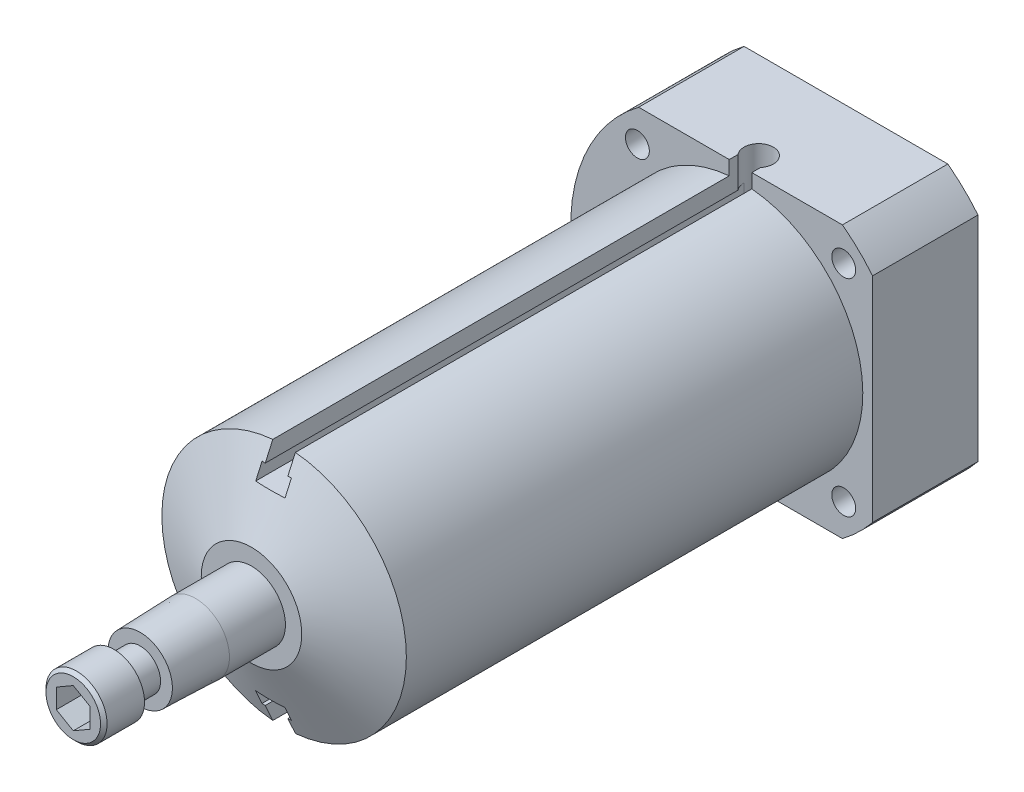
ISO-10303-21;
HEADER;
FILE_DESCRIPTION(('STEP AP214'),'2;1');
FILE_NAME('part.step','',(''),(''),'','','');
FILE_SCHEMA(('AUTOMOTIVE_DESIGN { 1 0 10303 214 1 1 1 1 }'));
ENDSEC;
DATA;
#1=APPLICATION_CONTEXT('core data for automotive mechanical design processes');
#2=APPLICATION_PROTOCOL_DEFINITION('international standard','automotive_design',2000,#1);
#3=PRODUCT_CONTEXT('',#1,'mechanical');
#4=PRODUCT('Part','Part','',(#3));
#5=PRODUCT_RELATED_PRODUCT_CATEGORY('part','',(#4));
#6=PRODUCT_DEFINITION_FORMATION('','',#4);
#7=PRODUCT_DEFINITION_CONTEXT('part definition',#1,'design');
#8=PRODUCT_DEFINITION('design','',#6,#7);
#9=PRODUCT_DEFINITION_SHAPE('','',#8);
#10=(LENGTH_UNIT() NAMED_UNIT(*) SI_UNIT(.MILLI.,.METRE.));
#11=(NAMED_UNIT(*) PLANE_ANGLE_UNIT() SI_UNIT($,.RADIAN.));
#12=(NAMED_UNIT(*) SI_UNIT($,.STERADIAN.) SOLID_ANGLE_UNIT());
#13=UNCERTAINTY_MEASURE_WITH_UNIT(LENGTH_MEASURE(1.E-05),#10,'distance_accuracy_value','');
#14=(GEOMETRIC_REPRESENTATION_CONTEXT(3) GLOBAL_UNCERTAINTY_ASSIGNED_CONTEXT((#13)) GLOBAL_UNIT_ASSIGNED_CONTEXT((#10,
#11,#12)) REPRESENTATION_CONTEXT('',''));
#15=CARTESIAN_POINT('',(0.,0.,0.));
#16=DIRECTION('',(0.,0.,1.));
#17=DIRECTION('',(1.,0.,0.));
#18=AXIS2_PLACEMENT_3D('',#15,#16,#17);
#19=CARTESIAN_POINT('',(0.,0.,138.938));
#20=DIRECTION('',(0.,0.,-1.));
#21=DIRECTION('',(-1.,0.,0.));
#22=AXIS2_PLACEMENT_3D('',#19,#20,#21);
#23=CYLINDRICAL_SURFACE('',#22,39.6875);
#24=CARTESIAN_POINT('',(-34.0099543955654,20.4553332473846,15.7988));
#25=CARTESIAN_POINT('',(-34.0099612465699,20.4553253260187,15.5655088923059));
#26=CARTESIAN_POINT('',(-34.0201595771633,20.4383952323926,15.332065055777));
#27=CARTESIAN_POINT('',(-34.0605308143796,20.3710426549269,14.8716541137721));
#28=CARTESIAN_POINT('',(-34.0907255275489,20.3205836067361,14.6446943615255));
#29=CARTESIAN_POINT('',(-34.1697333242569,20.1874450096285,14.2039854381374));
#30=CARTESIAN_POINT('',(-34.2185348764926,20.1047854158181,13.9902281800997));
#31=CARTESIAN_POINT('',(-34.3326396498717,19.9093008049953,13.5818280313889));
#32=CARTESIAN_POINT('',(-34.3979396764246,19.7964816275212,13.387181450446));
#33=CARTESIAN_POINT('',(-34.5425907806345,19.5429881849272,13.0217061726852));
#34=CARTESIAN_POINT('',(-34.6219909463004,19.4022163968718,12.850964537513));
#35=CARTESIAN_POINT('',(-34.7915103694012,19.0965687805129,12.5388960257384));
#36=CARTESIAN_POINT('',(-34.8816301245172,18.9316918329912,12.3975705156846));
#37=CARTESIAN_POINT('',(-35.0693703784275,18.5816145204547,12.1480426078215));
#38=CARTESIAN_POINT('',(-35.1670077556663,18.3963679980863,12.0399176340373));
#39=CARTESIAN_POINT('',(-35.3660566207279,18.0107392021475,11.8603554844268));
#40=CARTESIAN_POINT('',(-35.4674680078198,17.8103573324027,11.788917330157));
#41=CARTESIAN_POINT('',(-35.670240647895,17.4006783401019,11.6850130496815));
#42=CARTESIAN_POINT('',(-35.7716006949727,17.1914169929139,11.6524035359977));
#43=CARTESIAN_POINT('',(-35.9714865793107,16.7691491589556,11.6266384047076));
#44=CARTESIAN_POINT('',(-36.070012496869,16.5561427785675,11.6334816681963));
#45=CARTESIAN_POINT('',(-36.2610876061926,16.1333445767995,11.686311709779));
#46=CARTESIAN_POINT('',(-36.3536587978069,15.9235434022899,11.7321442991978));
#47=CARTESIAN_POINT('',(-36.5309915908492,15.5123972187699,11.8614116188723));
#48=CARTESIAN_POINT('',(-36.6157530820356,15.3110523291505,11.9448468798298));
#49=CARTESIAN_POINT('',(-36.7758701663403,14.9223772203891,12.1471192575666));
#50=CARTESIAN_POINT('',(-36.8512073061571,14.7350747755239,12.2660243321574));
#51=CARTESIAN_POINT('',(-36.9910109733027,14.3805125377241,12.5358116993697));
#52=CARTESIAN_POINT('',(-37.0554771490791,14.2132533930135,12.6866950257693));
#53=CARTESIAN_POINT('',(-37.1729585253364,13.9031113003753,13.0170223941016));
#54=CARTESIAN_POINT('',(-37.2259170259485,13.760349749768,13.1966006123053));
#55=CARTESIAN_POINT('',(-37.3194371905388,13.5046606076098,13.5787557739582));
#56=CARTESIAN_POINT('',(-37.359998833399,13.3917330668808,13.7813327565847));
#57=CARTESIAN_POINT('',(-37.4284165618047,13.1993095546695,14.2038409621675));
#58=CARTESIAN_POINT('',(-37.4562695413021,13.1198217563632,14.4237764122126));
#59=CARTESIAN_POINT('',(-37.4990873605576,12.996937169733,14.8747055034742));
#60=CARTESIAN_POINT('',(-37.5140526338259,12.9535391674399,15.1056987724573));
#61=CARTESIAN_POINT('',(-37.530983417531,12.9044033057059,15.5710089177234));
#62=CARTESIAN_POINT('',(-37.5330104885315,12.8984871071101,15.8053047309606));
#63=CARTESIAN_POINT('',(-37.5242199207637,12.9240377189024,16.2716025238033));
#64=CARTESIAN_POINT('',(-37.5134024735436,12.9555039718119,16.5036045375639));
#65=CARTESIAN_POINT('',(-37.4790132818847,13.0546518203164,16.9581793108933));
#66=CARTESIAN_POINT('',(-37.4554712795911,13.1222489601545,17.1807727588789));
#67=CARTESIAN_POINT('',(-37.3957809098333,13.2913965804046,17.6108556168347));
#68=CARTESIAN_POINT('',(-37.3596322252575,13.392947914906,17.8183446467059));
#69=CARTESIAN_POINT('',(-37.2748236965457,13.6272040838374,18.213182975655));
#70=CARTESIAN_POINT('',(-37.2261174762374,13.7600242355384,18.4004538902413));
#71=CARTESIAN_POINT('',(-37.1167158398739,14.0524506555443,18.7487442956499));
#72=CARTESIAN_POINT('',(-37.0560200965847,14.2120576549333,18.9097630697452));
#73=CARTESIAN_POINT('',(-36.9231210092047,14.5538476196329,19.2016277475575));
#74=CARTESIAN_POINT('',(-36.8508728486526,14.7361178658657,19.3323510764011));
#75=CARTESIAN_POINT('',(-36.6961919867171,15.1171881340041,19.5590697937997));
#76=CARTESIAN_POINT('',(-36.613759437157,15.3159879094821,19.655065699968));
#77=CARTESIAN_POINT('',(-36.4405028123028,15.7237510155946,19.8093978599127));
#78=CARTESIAN_POINT('',(-36.3496955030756,15.9326936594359,19.8678075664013));
#79=CARTESIAN_POINT('',(-36.1616853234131,16.3549243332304,19.9455488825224));
#80=CARTESIAN_POINT('',(-36.0644826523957,16.5682122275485,19.9648817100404));
#81=CARTESIAN_POINT('',(-35.8667929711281,16.991916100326,19.9639023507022));
#82=CARTESIAN_POINT('',(-35.7663239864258,17.2023409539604,19.9437802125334));
#83=CARTESIAN_POINT('',(-35.5646776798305,17.6154537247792,19.8648613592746));
#84=CARTESIAN_POINT('',(-35.4635003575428,17.8181416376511,19.8060646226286));
#85=CARTESIAN_POINT('',(-35.2637694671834,18.2102350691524,19.6515195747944));
#86=CARTESIAN_POINT('',(-35.1652154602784,18.3996428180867,19.5557774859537));
#87=CARTESIAN_POINT('',(-34.9741689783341,18.7602465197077,19.3300795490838));
#88=CARTESIAN_POINT('',(-34.8816764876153,18.931442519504,19.2001237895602));
#89=CARTESIAN_POINT('',(-34.7057763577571,19.2520229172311,18.9089761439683));
#90=CARTESIAN_POINT('',(-34.6224126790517,19.401302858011,18.747642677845));
#91=CARTESIAN_POINT('',(-34.4685288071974,19.673400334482,18.3986025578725));
#92=CARTESIAN_POINT('',(-34.398011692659,19.7962115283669,18.2108896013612));
#93=CARTESIAN_POINT('',(-34.2725805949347,20.0125862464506,17.8138426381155));
#94=CARTESIAN_POINT('',(-34.2177104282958,20.1060677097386,17.6044501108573));
#95=CARTESIAN_POINT('',(-34.1262554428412,20.2609107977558,17.1705400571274));
#96=CARTESIAN_POINT('',(-34.0896501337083,20.3223084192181,16.9460398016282));
#97=CARTESIAN_POINT('',(-34.0454016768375,20.3963080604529,16.5667059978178));
#98=CARTESIAN_POINT('',(-34.0321355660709,20.4184158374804,16.4142922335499));
#99=CARTESIAN_POINT('',(-34.0144096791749,20.4479310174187,16.1075412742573));
#100=CARTESIAN_POINT('',(-34.0099498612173,20.4553384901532,15.9532040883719));
#101=CARTESIAN_POINT('',(-34.0099543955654,20.4553332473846,15.7988));
#102=B_SPLINE_CURVE_WITH_KNOTS('',3,(#24,#25,#26,#27,#28,#29,#30,#31,#32,#33,#34,#35,#36,#37,
#38,#39,#40,#41,#42,#43,#44,#45,#46,#47,#48,#49,#50,#51,#52,#53,#54,#55,#56,#57,#58,#59,#60,#61,
#62,#63,#64,#65,#66,#67,#68,#69,#70,#71,#72,#73,#74,#75,#76,#77,#78,#79,#80,#81,#82,#83,#84,#85,
#86,#87,#88,#89,#90,#91,#92,#93,#94,#95,#96,#97,#98,#99,#100,#101),.UNSPECIFIED.,.T.,.F.,(4,2,2,
2,2,2,2,2,2,2,2,2,2,2,2,2,2,2,2,2,2,2,2,2,2,2,2,2,2,2,2,2,2,2,2,2,2,2,4),(0.,0.699309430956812,
1.39938273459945,2.09902288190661,2.79852766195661,3.50051721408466,4.2025393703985,
4.90618643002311,5.6098147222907,6.31083649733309,7.01183839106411,7.71008089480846,
8.40833325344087,9.10793210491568,9.80755357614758,10.5105477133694,11.2135430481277,
11.9167101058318,12.6198535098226,13.3196488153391,14.0194336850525,14.7175899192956,
15.4157637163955,16.1165538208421,16.8173630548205,17.5209600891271,18.2245466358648,
18.9267539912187,19.6289394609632,20.3277509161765,21.0265627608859,21.7252569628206,
22.4239493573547,23.1258707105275,23.8279600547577,24.5319965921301,25.2352415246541,
25.6980827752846,26.1609218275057),.UNSPECIFIED.);
#103=CARTESIAN_POINT('',(-34.0099543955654,20.4553332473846,15.7988));
#104=VERTEX_POINT('',#103);
#105=EDGE_CURVE('E517',#104,#104,#102,.T.);
#106=ORIENTED_EDGE('',*,*,#105,.F.);
#107=EDGE_LOOP('',(#106));
#108=FACE_BOUND('',#107,.T.);
#109=DIRECTION('',(0.,0.,-1.));
#110=VECTOR('',#109,1.);
#111=CARTESIAN_POINT('',(-23.8125,-31.75,138.938));
#112=LINE('',#111,#110);
#113=CARTESIAN_POINT('',(-23.8125,-31.75,24.638));
#114=VERTEX_POINT('',#113);
#115=CARTESIAN_POINT('',(-23.8125,-31.75,0.));
#116=VERTEX_POINT('',#115);
#117=EDGE_CURVE('E584',#114,#116,#112,.T.);
#118=ORIENTED_EDGE('',*,*,#117,.F.);
#119=CARTESIAN_POINT('',(0.,0.,24.638));
#120=DIRECTION('',(0.,0.,-1.));
#121=DIRECTION('',(-1.,0.,0.));
#122=AXIS2_PLACEMENT_3D('',#119,#120,#121);
#123=CIRCLE('',#122,39.6875);
#124=CARTESIAN_POINT('',(-23.8125,31.75,24.638));
#125=VERTEX_POINT('',#124);
#126=EDGE_CURVE('E587',#114,#125,#123,.T.);
#127=ORIENTED_EDGE('',*,*,#126,.T.);
#128=DIRECTION('',(0.,0.,-1.));
#129=VECTOR('',#128,1.);
#130=CARTESIAN_POINT('',(-23.8125,31.75,138.938));
#131=LINE('',#130,#129);
#132=CARTESIAN_POINT('',(-23.8125,31.75,0.));
#133=VERTEX_POINT('',#132);
#134=EDGE_CURVE('E753',#125,#133,#131,.T.);
#135=ORIENTED_EDGE('',*,*,#134,.T.);
#136=CARTESIAN_POINT('',(0.,0.,0.));
#137=DIRECTION('',(0.,0.,1.));
#138=DIRECTION('',(1.,0.,0.));
#139=AXIS2_PLACEMENT_3D('',#136,#137,#138);
#140=CIRCLE('',#139,39.6875);
#141=EDGE_CURVE('E590',#133,#116,#140,.T.);
#142=ORIENTED_EDGE('',*,*,#141,.T.);
#143=EDGE_LOOP('',(#118,#127,#135,#142));
#144=FACE_BOUND('',#143,.T.);
#145=CARTESIAN_POINT('',(-34.0099543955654,-20.4553332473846,15.7988));
#146=CARTESIAN_POINT('',(-34.0099612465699,-20.4553253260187,16.0320911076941));
#147=CARTESIAN_POINT('',(-34.0201595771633,-20.4383952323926,16.2655349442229));
#148=CARTESIAN_POINT('',(-34.0605308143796,-20.3710426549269,16.7259458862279));
#149=CARTESIAN_POINT('',(-34.0907255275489,-20.3205836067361,16.9529056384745));
#150=CARTESIAN_POINT('',(-34.1697333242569,-20.1874450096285,17.3936145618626));
#151=CARTESIAN_POINT('',(-34.2185348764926,-20.1047854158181,17.6073718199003));
#152=CARTESIAN_POINT('',(-34.3326396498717,-19.9093008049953,18.0157719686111));
#153=CARTESIAN_POINT('',(-34.3979396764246,-19.7964816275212,18.210418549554));
#154=CARTESIAN_POINT('',(-34.5425907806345,-19.5429881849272,18.5758938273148));
#155=CARTESIAN_POINT('',(-34.6219909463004,-19.4022163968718,18.746635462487));
#156=CARTESIAN_POINT('',(-34.7915103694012,-19.0965687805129,19.0587039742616));
#157=CARTESIAN_POINT('',(-34.8816301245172,-18.9316918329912,19.2000294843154));
#158=CARTESIAN_POINT('',(-35.0693703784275,-18.5816145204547,19.4495573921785));
#159=CARTESIAN_POINT('',(-35.1670077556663,-18.3963679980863,19.5576823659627));
#160=CARTESIAN_POINT('',(-35.3660566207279,-18.0107392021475,19.7372445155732));
#161=CARTESIAN_POINT('',(-35.4674680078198,-17.8103573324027,19.808682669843));
#162=CARTESIAN_POINT('',(-35.670240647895,-17.4006783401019,19.9125869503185));
#163=CARTESIAN_POINT('',(-35.7716006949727,-17.1914169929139,19.9451964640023));
#164=CARTESIAN_POINT('',(-35.9714865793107,-16.7691491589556,19.9709615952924));
#165=CARTESIAN_POINT('',(-36.070012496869,-16.5561427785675,19.9641183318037));
#166=CARTESIAN_POINT('',(-36.2610876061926,-16.1333445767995,19.911288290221));
#167=CARTESIAN_POINT('',(-36.3536587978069,-15.9235434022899,19.8654557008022));
#168=CARTESIAN_POINT('',(-36.5309915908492,-15.5123972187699,19.7361883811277));
#169=CARTESIAN_POINT('',(-36.6157530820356,-15.3110523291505,19.6527531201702));
#170=CARTESIAN_POINT('',(-36.7758701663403,-14.9223772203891,19.4504807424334));
#171=CARTESIAN_POINT('',(-36.8512073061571,-14.7350747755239,19.3315756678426));
#172=CARTESIAN_POINT('',(-36.9910109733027,-14.3805125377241,19.0617883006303));
#173=CARTESIAN_POINT('',(-37.0554771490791,-14.2132533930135,18.9109049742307));
#174=CARTESIAN_POINT('',(-37.1729585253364,-13.9031113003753,18.5805776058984));
#175=CARTESIAN_POINT('',(-37.2259170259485,-13.760349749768,18.4009993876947));
#176=CARTESIAN_POINT('',(-37.3194371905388,-13.5046606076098,18.0188442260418));
#177=CARTESIAN_POINT('',(-37.359998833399,-13.3917330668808,17.8162672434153));
#178=CARTESIAN_POINT('',(-37.4284165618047,-13.1993095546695,17.3937590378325));
#179=CARTESIAN_POINT('',(-37.4562695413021,-13.1198217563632,17.1738235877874));
#180=CARTESIAN_POINT('',(-37.4990873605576,-12.996937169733,16.7228944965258));
#181=CARTESIAN_POINT('',(-37.5140526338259,-12.9535391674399,16.4919012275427));
#182=CARTESIAN_POINT('',(-37.530983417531,-12.9044033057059,16.0265910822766));
#183=CARTESIAN_POINT('',(-37.5330104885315,-12.8984871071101,15.7922952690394));
#184=CARTESIAN_POINT('',(-37.5242199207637,-12.9240377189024,15.3259974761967));
#185=CARTESIAN_POINT('',(-37.5134024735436,-12.9555039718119,15.0939954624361));
#186=CARTESIAN_POINT('',(-37.4790132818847,-13.0546518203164,14.6394206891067));
#187=CARTESIAN_POINT('',(-37.4554712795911,-13.1222489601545,14.4168272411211));
#188=CARTESIAN_POINT('',(-37.3957809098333,-13.2913965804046,13.9867443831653));
#189=CARTESIAN_POINT('',(-37.3596322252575,-13.392947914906,13.7792553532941));
#190=CARTESIAN_POINT('',(-37.2748236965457,-13.6272040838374,13.384417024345));
#191=CARTESIAN_POINT('',(-37.2261174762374,-13.7600242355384,13.1971461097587));
#192=CARTESIAN_POINT('',(-37.1167158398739,-14.0524506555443,12.8488557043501));
#193=CARTESIAN_POINT('',(-37.0560200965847,-14.2120576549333,12.6878369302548));
#194=CARTESIAN_POINT('',(-36.9231210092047,-14.5538476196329,12.3959722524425));
#195=CARTESIAN_POINT('',(-36.8508728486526,-14.7361178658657,12.2652489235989));
#196=CARTESIAN_POINT('',(-36.6961919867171,-15.1171881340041,12.0385302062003));
#197=CARTESIAN_POINT('',(-36.613759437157,-15.3159879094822,11.942534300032));
#198=CARTESIAN_POINT('',(-36.4405028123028,-15.7237510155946,11.7882021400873));
#199=CARTESIAN_POINT('',(-36.3496955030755,-15.9326936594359,11.7297924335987));
#200=CARTESIAN_POINT('',(-36.1616853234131,-16.3549243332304,11.6520511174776));
#201=CARTESIAN_POINT('',(-36.0644826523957,-16.5682122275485,11.6327182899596));
#202=CARTESIAN_POINT('',(-35.8667929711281,-16.991916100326,11.6336976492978));
#203=CARTESIAN_POINT('',(-35.7663239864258,-17.2023409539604,11.6538197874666));
#204=CARTESIAN_POINT('',(-35.5646776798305,-17.6154537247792,11.7327386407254));
#205=CARTESIAN_POINT('',(-35.4635003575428,-17.8181416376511,11.7915353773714));
#206=CARTESIAN_POINT('',(-35.2637694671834,-18.2102350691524,11.9460804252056));
#207=CARTESIAN_POINT('',(-35.1652154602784,-18.3996428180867,12.0418225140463));
#208=CARTESIAN_POINT('',(-34.9741689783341,-18.7602465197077,12.2675204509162));
#209=CARTESIAN_POINT('',(-34.8816764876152,-18.931442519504,12.3974762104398));
#210=CARTESIAN_POINT('',(-34.7057763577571,-19.2520229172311,12.6886238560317));
#211=CARTESIAN_POINT('',(-34.6224126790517,-19.401302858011,12.849957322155));
#212=CARTESIAN_POINT('',(-34.4685288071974,-19.673400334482,13.1989974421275));
#213=CARTESIAN_POINT('',(-34.398011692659,-19.7962115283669,13.3867103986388));
#214=CARTESIAN_POINT('',(-34.2725805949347,-20.0125862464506,13.7837573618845));
#215=CARTESIAN_POINT('',(-34.2177104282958,-20.1060677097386,13.9931498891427));
#216=CARTESIAN_POINT('',(-34.1262554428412,-20.2609107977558,14.4270599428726));
#217=CARTESIAN_POINT('',(-34.0896501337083,-20.3223084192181,14.6515601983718));
#218=CARTESIAN_POINT('',(-34.0454016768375,-20.3963080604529,15.0308940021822));
#219=CARTESIAN_POINT('',(-34.0321355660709,-20.4184158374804,15.1833077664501));
#220=CARTESIAN_POINT('',(-34.0144096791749,-20.4479310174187,15.4900587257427));
#221=CARTESIAN_POINT('',(-34.0099498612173,-20.4553384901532,15.6443959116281));
#222=CARTESIAN_POINT('',(-34.0099543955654,-20.4553332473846,15.7988));
#223=B_SPLINE_CURVE_WITH_KNOTS('',3,(#145,#146,#147,#148,#149,#150,#151,#152,#153,#154,#155,
#156,#157,#158,#159,#160,#161,#162,#163,#164,#165,#166,#167,#168,#169,#170,#171,#172,#173,#174,
#175,#176,#177,#178,#179,#180,#181,#182,#183,#184,#185,#186,#187,#188,#189,#190,#191,#192,#193,
#194,#195,#196,#197,#198,#199,#200,#201,#202,#203,#204,#205,#206,#207,#208,#209,#210,#211,#212,
#213,#214,#215,#216,#217,#218,#219,#220,#221,#222),.UNSPECIFIED.,.T.,.F.,(4,2,2,2,2,2,2,2,2,2,2,
2,2,2,2,2,2,2,2,2,2,2,2,2,2,2,2,2,2,2,2,2,2,2,2,2,2,2,4),(0.,0.699309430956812,1.39938273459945,
2.09902288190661,2.79852766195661,3.50051721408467,4.2025393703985,4.90618643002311,
5.6098147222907,6.31083649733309,7.01183839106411,7.71008089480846,8.40833325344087,
9.10793210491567,9.80755357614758,10.5105477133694,11.2135430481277,11.9167101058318,
12.6198535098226,13.3196488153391,14.0194336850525,14.7175899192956,15.4157637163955,
16.1165538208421,16.8173630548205,17.5209600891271,18.2245466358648,18.9267539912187,
19.6289394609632,20.3277509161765,21.0265627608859,21.7252569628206,22.4239493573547,
23.1258707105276,23.8279600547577,24.5319965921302,25.2352415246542,25.6980827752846,
26.1609218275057),.UNSPECIFIED.);
#224=CARTESIAN_POINT('',(-34.0099543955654,-20.4553332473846,15.7988));
#225=VERTEX_POINT('',#224);
#226=EDGE_CURVE('E510',#225,#225,#223,.T.);
#227=ORIENTED_EDGE('',*,*,#226,.F.);
#228=EDGE_LOOP('',(#227));
#229=FACE_BOUND('',#228,.T.);
#230=ADVANCED_FACE('F36',(#108,#144,#229),#23,.T.);
#231=CARTESIAN_POINT('',(-39.6875,0.,24.638));
#232=DIRECTION('',(0.,0.,-1.));
#233=DIRECTION('',(-1.,0.,0.));
#234=AXIS2_PLACEMENT_3D('',#231,#232,#233);
#235=PLANE('',#234);
#236=CARTESIAN_POINT('',(-24.1119876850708,-24.1119876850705,24.638));
#237=DIRECTION('',(0.,0.,1.));
#238=DIRECTION('',(1.,0.,0.));
#239=AXIS2_PLACEMENT_3D('',#236,#237,#238);
#240=CIRCLE('',#239,2.79400000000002);
#241=CARTESIAN_POINT('',(-21.3179876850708,-24.1119876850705,24.638));
#242=VERTEX_POINT('',#241);
#243=EDGE_CURVE('E694',#242,#242,#240,.T.);
#244=ORIENTED_EDGE('',*,*,#243,.F.);
#245=EDGE_LOOP('',(#244));
#246=FACE_BOUND('',#245,.T.);
#247=CARTESIAN_POINT('',(24.1119876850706,24.1119876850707,24.638));
#248=DIRECTION('',(0.,0.,1.));
#249=DIRECTION('',(1.,0.,0.));
#250=AXIS2_PLACEMENT_3D('',#247,#248,#249);
#251=CIRCLE('',#250,2.79400000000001);
#252=CARTESIAN_POINT('',(26.9059876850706,24.1119876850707,24.638));
#253=VERTEX_POINT('',#252);
#254=EDGE_CURVE('E706',#253,#253,#251,.T.);
#255=ORIENTED_EDGE('',*,*,#254,.F.);
#256=EDGE_LOOP('',(#255));
#257=FACE_BOUND('',#256,.T.);
#258=DIRECTION('',(1.,0.,0.));
#259=VECTOR('',#258,1.);
#260=CARTESIAN_POINT('',(-23.8125,31.75,24.638));
#261=LINE('',#260,#259);
#262=CARTESIAN_POINT('',(2.6416,31.75,24.638));
#263=VERTEX_POINT('',#262);
#264=CARTESIAN_POINT('',(23.8125,31.75,24.638));
#265=VERTEX_POINT('',#264);
#266=EDGE_CURVE('E595',#263,#265,#261,.T.);
#267=ORIENTED_EDGE('',*,*,#266,.F.);
#268=DIRECTION('',(0.,-1.,0.));
#269=VECTOR('',#268,1.);
#270=CARTESIAN_POINT('',(2.64159999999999,0.,24.638));
#271=LINE('',#270,#269);
#272=CARTESIAN_POINT('',(2.6416,28.45263738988,24.638));
#273=VERTEX_POINT('',#272);
#274=EDGE_CURVE('E680',#263,#273,#271,.T.);
#275=ORIENTED_EDGE('',*,*,#274,.T.);
#276=CARTESIAN_POINT('',(0.,0.,24.638));
#277=DIRECTION('',(0.,0.,-1.));
#278=DIRECTION('',(-1.,0.,0.));
#279=AXIS2_PLACEMENT_3D('',#276,#277,#278);
#280=CIRCLE('',#279,28.575);
#281=CARTESIAN_POINT('',(-2.6416,28.45263738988,24.638));
#282=VERTEX_POINT('',#281);
#283=EDGE_CURVE('E727',#273,#282,#280,.T.);
#284=ORIENTED_EDGE('',*,*,#283,.T.);
#285=DIRECTION('',(0.,1.,0.));
#286=VECTOR('',#285,1.);
#287=CARTESIAN_POINT('',(-2.64159999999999,0.,24.638));
#288=LINE('',#287,#286);
#289=CARTESIAN_POINT('',(-2.6416,31.75,24.638));
#290=VERTEX_POINT('',#289);
#291=EDGE_CURVE('E672',#282,#290,#288,.T.);
#292=ORIENTED_EDGE('',*,*,#291,.T.);
#293=EDGE_CURVE('E598',#125,#290,#261,.T.);
#294=ORIENTED_EDGE('',*,*,#293,.F.);
#295=ORIENTED_EDGE('',*,*,#126,.F.);
#296=DIRECTION('',(-1.,0.,0.));
#297=VECTOR('',#296,1.);
#298=CARTESIAN_POINT('',(-23.8125,-31.75,24.638));
#299=LINE('',#298,#297);
#300=CARTESIAN_POINT('',(23.8125,-31.75,24.638));
#301=VERTEX_POINT('',#300);
#302=EDGE_CURVE('E736',#301,#114,#299,.T.);
#303=ORIENTED_EDGE('',*,*,#302,.F.);
#304=CARTESIAN_POINT('',(30.861,-24.9538841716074,24.638));
#305=VERTEX_POINT('',#304);
#306=EDGE_CURVE('E731',#305,#301,#123,.T.);
#307=ORIENTED_EDGE('',*,*,#306,.F.);
#308=DIRECTION('',(0.,-1.,0.));
#309=VECTOR('',#308,1.);
#310=CARTESIAN_POINT('',(30.861,24.9538841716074,24.638));
#311=LINE('',#310,#309);
#312=CARTESIAN_POINT('',(30.861,24.9538841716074,24.638));
#313=VERTEX_POINT('',#312);
#314=EDGE_CURVE('E733',#313,#305,#311,.T.);
#315=ORIENTED_EDGE('',*,*,#314,.F.);
#316=EDGE_CURVE('E732',#265,#313,#123,.T.);
#317=ORIENTED_EDGE('',*,*,#316,.F.);
#318=EDGE_LOOP('',(#267,#275,#284,#292,#294,#295,#303,#307,#315,#317));
#319=FACE_BOUND('',#318,.T.);
#320=CARTESIAN_POINT('',(24.1119876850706,-24.1119876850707,24.638));
#321=DIRECTION('',(0.,0.,1.));
#322=DIRECTION('',(1.,0.,0.));
#323=AXIS2_PLACEMENT_3D('',#320,#321,#322);
#324=CIRCLE('',#323,2.79400000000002);
#325=CARTESIAN_POINT('',(26.9059876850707,-24.1119876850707,24.638));
#326=VERTEX_POINT('',#325);
#327=EDGE_CURVE('E700',#326,#326,#324,.T.);
#328=ORIENTED_EDGE('',*,*,#327,.F.);
#329=EDGE_LOOP('',(#328));
#330=FACE_BOUND('',#329,.T.);
#331=CARTESIAN_POINT('',(-24.1119876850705,24.1119876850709,24.638));
#332=DIRECTION('',(0.,0.,1.));
#333=DIRECTION('',(1.,0.,0.));
#334=AXIS2_PLACEMENT_3D('',#331,#332,#333);
#335=CIRCLE('',#334,2.79400000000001);
#336=CARTESIAN_POINT('',(-21.3179876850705,24.1119876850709,24.638));
#337=VERTEX_POINT('',#336);
#338=EDGE_CURVE('E522',#337,#337,#335,.T.);
#339=ORIENTED_EDGE('',*,*,#338,.F.);
#340=EDGE_LOOP('',(#339));
#341=FACE_BOUND('',#340,.T.);
#342=ADVANCED_FACE('F571',(#246,#257,#319,#330,#341),#235,.F.);
#343=CARTESIAN_POINT('',(-23.8125,-31.75,138.938));
#344=DIRECTION('',(0.,1.,0.));
#345=DIRECTION('',(0.,0.,1.));
#346=AXIS2_PLACEMENT_3D('',#343,#344,#345);
#347=PLANE('',#346);
#348=DIRECTION('',(0.,0.,-1.));
#349=VECTOR('',#348,1.);
#350=CARTESIAN_POINT('',(23.8125,-31.75,138.938));
#351=LINE('',#350,#349);
#352=CARTESIAN_POINT('',(23.8125,-31.75,0.));
#353=VERTEX_POINT('',#352);
#354=EDGE_CURVE('E596',#301,#353,#351,.T.);
#355=ORIENTED_EDGE('',*,*,#354,.F.);
#356=ORIENTED_EDGE('',*,*,#302,.T.);
#357=ORIENTED_EDGE('',*,*,#117,.T.);
#358=DIRECTION('',(1.,0.,0.));
#359=VECTOR('',#358,1.);
#360=CARTESIAN_POINT('',(-23.8125,-31.75,0.));
#361=LINE('',#360,#359);
#362=EDGE_CURVE('E739',#116,#353,#361,.T.);
#363=ORIENTED_EDGE('',*,*,#362,.T.);
#364=EDGE_LOOP('',(#355,#356,#357,#363));
#365=FACE_BOUND('',#364,.T.);
#366=ADVANCED_FACE('F576',(#365),#347,.F.);
#367=CARTESIAN_POINT('',(0.,0.,138.938));
#368=DIRECTION('',(0.,0.,-1.));
#369=DIRECTION('',(-1.,0.,0.));
#370=AXIS2_PLACEMENT_3D('',#367,#368,#369);
#371=CYLINDRICAL_SURFACE('',#370,39.6875);
#372=DIRECTION('',(0.,0.,-1.));
#373=VECTOR('',#372,1.);
#374=CARTESIAN_POINT('',(30.861,-24.9538841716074,138.938));
#375=LINE('',#374,#373);
#376=CARTESIAN_POINT('',(30.861,-24.9538841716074,0.));
#377=VERTEX_POINT('',#376);
#378=EDGE_CURVE('E599',#305,#377,#375,.T.);
#379=ORIENTED_EDGE('',*,*,#378,.F.);
#380=ORIENTED_EDGE('',*,*,#306,.T.);
#381=ORIENTED_EDGE('',*,*,#354,.T.);
#382=CARTESIAN_POINT('',(0.,0.,0.));
#383=DIRECTION('',(0.,0.,1.));
#384=DIRECTION('',(1.,0.,0.));
#385=AXIS2_PLACEMENT_3D('',#382,#383,#384);
#386=CIRCLE('',#385,39.6875);
#387=EDGE_CURVE('E741',#353,#377,#386,.T.);
#388=ORIENTED_EDGE('',*,*,#387,.T.);
#389=EDGE_LOOP('',(#379,#380,#381,#388));
#390=FACE_BOUND('',#389,.T.);
#391=ADVANCED_FACE('F767',(#390),#371,.T.);
#392=CARTESIAN_POINT('',(30.861,24.9538841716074,138.938));
#393=DIRECTION('',(-1.,0.,0.));
#394=DIRECTION('',(0.,0.,1.));
#395=AXIS2_PLACEMENT_3D('',#392,#393,#394);
#396=PLANE('',#395);
#397=DIRECTION('',(0.,0.,-1.));
#398=VECTOR('',#397,1.);
#399=CARTESIAN_POINT('',(30.861,24.9538841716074,138.938));
#400=LINE('',#399,#398);
#401=CARTESIAN_POINT('',(30.861,24.9538841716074,0.));
#402=VERTEX_POINT('',#401);
#403=EDGE_CURVE('E757',#313,#402,#400,.T.);
#404=ORIENTED_EDGE('',*,*,#403,.F.);
#405=ORIENTED_EDGE('',*,*,#314,.T.);
#406=ORIENTED_EDGE('',*,*,#378,.T.);
#407=DIRECTION('',(0.,1.,0.));
#408=VECTOR('',#407,1.);
#409=CARTESIAN_POINT('',(30.861,24.9538841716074,0.));
#410=LINE('',#409,#408);
#411=EDGE_CURVE('E744',#377,#402,#410,.T.);
#412=ORIENTED_EDGE('',*,*,#411,.T.);
#413=EDGE_LOOP('',(#404,#405,#406,#412));
#414=FACE_BOUND('',#413,.T.);
#415=ADVANCED_FACE('F761',(#414),#396,.F.);
#416=CARTESIAN_POINT('',(0.,0.,138.938));
#417=DIRECTION('',(0.,0.,-1.));
#418=DIRECTION('',(-1.,0.,0.));
#419=AXIS2_PLACEMENT_3D('',#416,#417,#418);
#420=CYLINDRICAL_SURFACE('',#419,39.6875);
#421=DIRECTION('',(0.,0.,-1.));
#422=VECTOR('',#421,1.);
#423=CARTESIAN_POINT('',(23.8125,31.75,138.938));
#424=LINE('',#423,#422);
#425=CARTESIAN_POINT('',(23.8125,31.75,0.));
#426=VERTEX_POINT('',#425);
#427=EDGE_CURVE('E755',#265,#426,#424,.T.);
#428=ORIENTED_EDGE('',*,*,#427,.F.);
#429=ORIENTED_EDGE('',*,*,#316,.T.);
#430=ORIENTED_EDGE('',*,*,#403,.T.);
#431=CARTESIAN_POINT('',(0.,0.,0.));
#432=DIRECTION('',(0.,0.,1.));
#433=DIRECTION('',(1.,0.,0.));
#434=AXIS2_PLACEMENT_3D('',#431,#432,#433);
#435=CIRCLE('',#434,39.6875);
#436=EDGE_CURVE('E747',#402,#426,#435,.T.);
#437=ORIENTED_EDGE('',*,*,#436,.T.);
#438=EDGE_LOOP('',(#428,#429,#430,#437));
#439=FACE_BOUND('',#438,.T.);
#440=ADVANCED_FACE('F774',(#439),#420,.T.);
#441=CARTESIAN_POINT('',(-23.8125,31.75,138.938));
#442=DIRECTION('',(0.,-1.,0.));
#443=DIRECTION('',(0.,0.,-1.));
#444=AXIS2_PLACEMENT_3D('',#441,#442,#443);
#445=PLANE('',#444);
#446=DIRECTION('',(0.,0.,-1.));
#447=VECTOR('',#446,1.);
#448=CARTESIAN_POINT('',(-2.6416,31.75,138.938));
#449=LINE('',#448,#447);
#450=CARTESIAN_POINT('',(-2.6416,31.75,22.5825189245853));
#451=VERTEX_POINT('',#450);
#452=EDGE_CURVE('E675',#290,#451,#449,.T.);
#453=ORIENTED_EDGE('',*,*,#452,.T.);
#454=CARTESIAN_POINT('',(0.,31.75,20.3962));
#455=DIRECTION('',(0.,1.,0.));
#456=DIRECTION('',(0.,0.,1.));
#457=AXIS2_PLACEMENT_3D('',#454,#455,#456);
#458=CIRCLE('',#457,3.429);
#459=CARTESIAN_POINT('',(2.6416,31.75,22.5825189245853));
#460=VERTEX_POINT('',#459);
#461=EDGE_CURVE('E60',#460,#451,#458,.T.);
#462=ORIENTED_EDGE('',*,*,#461,.F.);
#463=DIRECTION('',(0.,0.,1.));
#464=VECTOR('',#463,1.);
#465=CARTESIAN_POINT('',(2.6416,31.75,138.938));
#466=LINE('',#465,#464);
#467=EDGE_CURVE('E683',#460,#263,#466,.T.);
#468=ORIENTED_EDGE('',*,*,#467,.T.);
#469=ORIENTED_EDGE('',*,*,#266,.T.);
#470=ORIENTED_EDGE('',*,*,#427,.T.);
#471=DIRECTION('',(-1.,0.,0.));
#472=VECTOR('',#471,1.);
#473=CARTESIAN_POINT('',(-23.8125,31.75,0.));
#474=LINE('',#473,#472);
#475=EDGE_CURVE('E750',#426,#133,#474,.T.);
#476=ORIENTED_EDGE('',*,*,#475,.T.);
#477=ORIENTED_EDGE('',*,*,#134,.F.);
#478=ORIENTED_EDGE('',*,*,#293,.T.);
#479=EDGE_LOOP('',(#453,#462,#468,#469,#470,#476,#477,#478));
#480=FACE_BOUND('',#479,.T.);
#481=ADVANCED_FACE('F824',(#480),#445,.F.);
#482=CARTESIAN_POINT('',(0.,0.,0.));
#483=DIRECTION('',(0.,0.,1.));
#484=DIRECTION('',(1.,0.,0.));
#485=AXIS2_PLACEMENT_3D('',#482,#483,#484);
#486=PLANE('',#485);
#487=CARTESIAN_POINT('',(-24.1119876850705,24.1119876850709,0.));
#488=DIRECTION('',(0.,0.,1.));
#489=DIRECTION('',(1.,0.,0.));
#490=AXIS2_PLACEMENT_3D('',#487,#488,#489);
#491=CIRCLE('',#490,2.79400000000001);
#492=CARTESIAN_POINT('',(-21.3179876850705,24.1119876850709,0.));
#493=VERTEX_POINT('',#492);
#494=EDGE_CURVE('E691',#493,#493,#491,.T.);
#495=ORIENTED_EDGE('',*,*,#494,.T.);
#496=EDGE_LOOP('',(#495));
#497=FACE_BOUND('',#496,.T.);
#498=CARTESIAN_POINT('',(-24.1119876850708,-24.1119876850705,0.));
#499=DIRECTION('',(0.,0.,1.));
#500=DIRECTION('',(1.,0.,0.));
#501=AXIS2_PLACEMENT_3D('',#498,#499,#500);
#502=CIRCLE('',#501,2.79400000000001);
#503=CARTESIAN_POINT('',(-21.3179876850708,-24.1119876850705,0.));
#504=VERTEX_POINT('',#503);
#505=EDGE_CURVE('E697',#504,#504,#502,.T.);
#506=ORIENTED_EDGE('',*,*,#505,.T.);
#507=EDGE_LOOP('',(#506));
#508=FACE_BOUND('',#507,.T.);
#509=CARTESIAN_POINT('',(24.1119876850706,-24.1119876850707,0.));
#510=DIRECTION('',(0.,0.,1.));
#511=DIRECTION('',(1.,0.,0.));
#512=AXIS2_PLACEMENT_3D('',#509,#510,#511);
#513=CIRCLE('',#512,2.79400000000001);
#514=CARTESIAN_POINT('',(26.9059876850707,-24.1119876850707,0.));
#515=VERTEX_POINT('',#514);
#516=EDGE_CURVE('E703',#515,#515,#513,.T.);
#517=ORIENTED_EDGE('',*,*,#516,.T.);
#518=EDGE_LOOP('',(#517));
#519=FACE_BOUND('',#518,.T.);
#520=CARTESIAN_POINT('',(24.1119876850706,24.1119876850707,0.));
#521=DIRECTION('',(0.,0.,1.));
#522=DIRECTION('',(1.,0.,0.));
#523=AXIS2_PLACEMENT_3D('',#520,#521,#522);
#524=CIRCLE('',#523,2.79400000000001);
#525=CARTESIAN_POINT('',(26.9059876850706,24.1119876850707,0.));
#526=VERTEX_POINT('',#525);
#527=EDGE_CURVE('E709',#526,#526,#524,.T.);
#528=ORIENTED_EDGE('',*,*,#527,.T.);
#529=EDGE_LOOP('',(#528));
#530=FACE_BOUND('',#529,.T.);
#531=ORIENTED_EDGE('',*,*,#141,.F.);
#532=ORIENTED_EDGE('',*,*,#475,.F.);
#533=ORIENTED_EDGE('',*,*,#436,.F.);
#534=ORIENTED_EDGE('',*,*,#411,.F.);
#535=ORIENTED_EDGE('',*,*,#387,.F.);
#536=ORIENTED_EDGE('',*,*,#362,.F.);
#537=EDGE_LOOP('',(#531,#532,#533,#534,#535,#536));
#538=FACE_BOUND('',#537,.T.);
#539=ADVANCED_FACE('F770',(#497,#508,#519,#530,#538),#486,.F.);
#540=CARTESIAN_POINT('',(0.,0.,0.));
#541=DIRECTION('',(0.,0.,-1.));
#542=DIRECTION('',(-1.,0.,0.));
#543=AXIS2_PLACEMENT_3D('',#540,#541,#542);
#544=CYLINDRICAL_SURFACE('',#543,28.575);
#545=DIRECTION('',(0.,0.,-1.));
#546=VECTOR('',#545,1.);
#547=CARTESIAN_POINT('',(2.64160000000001,-28.45263738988,0.));
#548=LINE('',#547,#546);
#549=CARTESIAN_POINT('',(2.64160000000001,-28.45263738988,131.318));
#550=VERTEX_POINT('',#549);
#551=CARTESIAN_POINT('',(2.64160000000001,-28.45263738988,42.6993189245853));
#552=VERTEX_POINT('',#551);
#553=EDGE_CURVE('E645',#550,#552,#548,.T.);
#554=ORIENTED_EDGE('',*,*,#553,.T.);
#555=CARTESIAN_POINT('',(0.,-28.575,37.084));
#556=CARTESIAN_POINT('',(-0.191868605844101,-28.5749974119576,37.084008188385));
#557=CARTESIAN_POINT('',(-0.383858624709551,-28.5730470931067,37.1001582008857));
#558=CARTESIAN_POINT('',(-0.762500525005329,-28.5654544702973,37.1643312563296));
#559=CARTESIAN_POINT('',(-0.949146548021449,-28.5598082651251,37.2123879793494));
#560=CARTESIAN_POINT('',(-1.31156369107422,-28.5454602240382,37.3389418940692));
#561=CARTESIAN_POINT('',(-1.48734188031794,-28.5367603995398,37.4174190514));
#562=CARTESIAN_POINT('',(-1.82319833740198,-28.5172738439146,37.6025433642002));
#563=CARTESIAN_POINT('',(-1.98327938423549,-28.5064874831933,37.709185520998));
#564=CARTESIAN_POINT('',(-2.28404697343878,-28.4839716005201,37.9481935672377));
#565=CARTESIAN_POINT('',(-2.42464211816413,-28.4722380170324,38.0806741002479));
#566=CARTESIAN_POINT('',(-2.68166009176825,-28.4491830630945,38.3673523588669));
#567=CARTESIAN_POINT('',(-2.7980817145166,-28.4378617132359,38.5215511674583));
#568=CARTESIAN_POINT('',(-3.00378505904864,-28.4168728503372,38.847878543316));
#569=CARTESIAN_POINT('',(-3.09298172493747,-28.4072105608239,39.0200610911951));
#570=CARTESIAN_POINT('',(-3.24116003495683,-28.3906868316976,39.3770965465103));
#571=CARTESIAN_POINT('',(-3.30014273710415,-28.3838252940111,39.5619490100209));
#572=CARTESIAN_POINT('',(-3.38594239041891,-28.3737183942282,39.9381314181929));
#573=CARTESIAN_POINT('',(-3.41291316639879,-28.3704557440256,40.1294258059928));
#574=CARTESIAN_POINT('',(-3.43439924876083,-28.3678629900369,40.5138514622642));
#575=CARTESIAN_POINT('',(-3.42891576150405,-28.368532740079,40.706982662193));
#576=CARTESIAN_POINT('',(-3.38577535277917,-28.3737132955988,41.0885301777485));
#577=CARTESIAN_POINT('',(-3.34828754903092,-28.3782039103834,41.2769659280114));
#578=CARTESIAN_POINT('',(-3.24246635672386,-28.3904887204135,41.6448523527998));
#579=CARTESIAN_POINT('',(-3.17413238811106,-28.3982829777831,41.8243028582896));
#580=CARTESIAN_POINT('',(-3.00837577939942,-28.4163198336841,42.1696521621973));
#581=CARTESIAN_POINT('',(-2.91087931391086,-28.4265686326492,42.3355151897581));
#582=CARTESIAN_POINT('',(-2.68961813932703,-28.448354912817,42.6485894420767));
#583=CARTESIAN_POINT('',(-2.56585232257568,-28.4598924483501,42.7957998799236));
#584=CARTESIAN_POINT('',(-2.29462685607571,-28.4830460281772,43.0683720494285));
#585=CARTESIAN_POINT('',(-2.14702137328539,-28.4946621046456,43.1935887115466));
#586=CARTESIAN_POINT('',(-1.83280959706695,-28.5165950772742,43.4174904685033));
#587=CARTESIAN_POINT('',(-1.66620326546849,-28.5269119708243,43.5161755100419));
#588=CARTESIAN_POINT('',(-1.31860972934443,-28.5450898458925,43.6842115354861));
#589=CARTESIAN_POINT('',(-1.13761827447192,-28.5529500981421,43.7535538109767));
#590=CARTESIAN_POINT('',(-0.766445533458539,-28.5653222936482,43.8608226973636));
#591=CARTESIAN_POINT('',(-0.576264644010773,-28.5698343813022,43.8987506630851));
#592=CARTESIAN_POINT('',(-0.193366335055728,-28.5749831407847,43.9419271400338));
#593=CARTESIAN_POINT('',(-0.000671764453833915,-28.5756435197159,43.947375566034));
#594=CARTESIAN_POINT('',(0.382884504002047,-28.5730783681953,43.9259653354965));
#595=CARTESIAN_POINT('',(0.573746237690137,-28.5698529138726,43.8991073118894));
#596=CARTESIAN_POINT('',(0.947631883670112,-28.5598933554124,43.8140126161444));
#597=CARTESIAN_POINT('',(1.13067771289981,-28.553169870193,43.7558708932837));
#598=CARTESIAN_POINT('',(1.48442026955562,-28.5369673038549,43.6099576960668));
#599=CARTESIAN_POINT('',(1.65511660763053,-28.5274881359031,43.5221852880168));
#600=CARTESIAN_POINT('',(1.98020998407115,-28.5067726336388,43.3190159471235));
#601=CARTESIAN_POINT('',(2.13452539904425,-28.4955281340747,43.2034892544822));
#602=CARTESIAN_POINT('',(2.42164695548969,-28.4725663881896,42.9482748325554));
#603=CARTESIAN_POINT('',(2.55445231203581,-28.4608491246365,42.8085862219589));
#604=CARTESIAN_POINT('',(2.79548990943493,-28.4381896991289,42.5081343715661));
#605=CARTESIAN_POINT('',(2.90358991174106,-28.4272519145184,42.347264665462));
#606=CARTESIAN_POINT('',(3.09123566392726,-28.4074607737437,42.0095355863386));
#607=CARTESIAN_POINT('',(3.17078194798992,-28.3986073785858,41.8326765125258));
#608=CARTESIAN_POINT('',(3.29884655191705,-28.3840167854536,41.4684215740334));
#609=CARTESIAN_POINT('',(3.34744032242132,-28.3782720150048,41.2810525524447));
#610=CARTESIAN_POINT('',(3.41246390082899,-28.3705270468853,40.9007410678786));
#611=CARTESIAN_POINT('',(3.42889507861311,-28.3685266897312,40.7077988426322));
#612=CARTESIAN_POINT('',(3.42910325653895,-28.3685014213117,40.3231331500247));
#613=CARTESIAN_POINT('',(3.41308799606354,-28.3704512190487,40.1314097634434));
#614=CARTESIAN_POINT('',(3.34929688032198,-28.3780522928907,39.7534001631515));
#615=CARTESIAN_POINT('',(3.30152101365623,-28.3837035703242,39.5671139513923));
#616=CARTESIAN_POINT('',(3.17562821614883,-28.3980632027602,39.2052885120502));
#617=CARTESIAN_POINT('',(3.09752046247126,-28.4067706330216,39.0297460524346));
#618=CARTESIAN_POINT('',(2.91320162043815,-28.4262630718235,38.6942266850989));
#619=CARTESIAN_POINT('',(2.80699028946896,-28.4370480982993,38.534249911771));
#620=CARTESIAN_POINT('',(2.56870607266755,-28.4595633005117,38.2333402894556));
#621=CARTESIAN_POINT('',(2.43647828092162,-28.4712988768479,38.0925305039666));
#622=CARTESIAN_POINT('',(2.15023552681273,-28.4943447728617,37.835016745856));
#623=CARTESIAN_POINT('',(1.99621541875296,-28.5056549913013,37.7183184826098));
#624=CARTESIAN_POINT('',(1.67014385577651,-28.5266192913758,37.5119956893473));
#625=CARTESIAN_POINT('',(1.49803092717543,-28.5362674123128,37.4224677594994));
#626=CARTESIAN_POINT('',(1.14119720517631,-28.5527593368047,37.2737108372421));
#627=CARTESIAN_POINT('',(0.956490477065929,-28.5596062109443,37.2144486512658));
#628=CARTESIAN_POINT('',(0.642339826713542,-28.5680583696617,37.1422205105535));
#629=CARTESIAN_POINT('',(0.514883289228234,-28.5706489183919,37.1204188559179));
#630=CARTESIAN_POINT('',(0.258302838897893,-28.5741205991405,37.0913058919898));
#631=CARTESIAN_POINT('',(0.129178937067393,-28.5750017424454,37.0839944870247));
#632=CARTESIAN_POINT('',(0.,-28.575,37.084));
#633=B_SPLINE_CURVE_WITH_KNOTS('',3,(#555,#556,#557,#558,#559,#560,#561,#562,#563,#564,#565,
#566,#567,#568,#569,#570,#571,#572,#573,#574,#575,#576,#577,#578,#579,#580,#581,#582,#583,#584,
#585,#586,#587,#588,#589,#590,#591,#592,#593,#594,#595,#596,#597,#598,#599,#600,#601,#602,#603,
#604,#605,#606,#607,#608,#609,#610,#611,#612,#613,#614,#615,#616,#617,#618,#619,#620,#621,#622,
#623,#624,#625,#626,#627,#628,#629,#630,#631,#632),.UNSPECIFIED.,.T.,.F.,(4,2,2,2,2,2,2,2,2,2,2,
2,2,2,2,2,2,2,2,2,2,2,2,2,2,2,2,2,2,2,2,2,2,2,2,2,2,2,4),(0.,0.575133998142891,1.15087606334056,
1.72623959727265,2.30150108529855,2.87937555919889,3.45727885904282,4.03696958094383,
4.61664000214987,5.19351354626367,5.77036564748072,6.34418827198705,6.91802168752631,
7.49332024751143,8.06864306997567,8.64762875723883,9.22661560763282,9.8057741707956,
10.3849077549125,10.9604730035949,11.5360269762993,12.109843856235,12.6836788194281,
13.260250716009,13.8368436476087,14.4164541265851,14.996053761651,15.5742350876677,
16.1523917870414,16.7268585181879,17.3013254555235,17.8756187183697,18.4499169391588,
19.0277441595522,19.6057080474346,20.185703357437,20.7650611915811,21.1522828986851,
21.539502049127),.UNSPECIFIED.);
#634=CARTESIAN_POINT('',(-2.6416,-28.45263738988,42.6993189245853));
#635=VERTEX_POINT('',#634);
#636=EDGE_CURVE('E315',#552,#635,#633,.T.);
#637=ORIENTED_EDGE('',*,*,#636,.T.);
#638=DIRECTION('',(0.,0.,-1.));
#639=VECTOR('',#638,1.);
#640=CARTESIAN_POINT('',(-2.6416,-28.45263738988,0.));
#641=LINE('',#640,#639);
#642=CARTESIAN_POINT('',(-2.6416,-28.45263738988,131.318));
#643=VERTEX_POINT('',#642);
#644=EDGE_CURVE('E643',#635,#643,#641,.F.);
#645=ORIENTED_EDGE('',*,*,#644,.T.);
#646=CARTESIAN_POINT('',(0.,0.,131.318));
#647=DIRECTION('',(0.,0.,-1.));
#648=DIRECTION('',(-1.,0.,0.));
#649=AXIS2_PLACEMENT_3D('',#646,#647,#648);
#650=CIRCLE('',#649,28.575);
#651=CARTESIAN_POINT('',(-2.6416,28.45263738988,131.318));
#652=VERTEX_POINT('',#651);
#653=EDGE_CURVE('E723',#643,#652,#650,.T.);
#654=ORIENTED_EDGE('',*,*,#653,.T.);
#655=DIRECTION('',(0.,0.,-1.));
#656=VECTOR('',#655,1.);
#657=CARTESIAN_POINT('',(-2.6416,28.45263738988,0.));
#658=LINE('',#657,#656);
#659=EDGE_CURVE('E656',#652,#282,#658,.T.);
#660=ORIENTED_EDGE('',*,*,#659,.T.);
#661=ORIENTED_EDGE('',*,*,#283,.F.);
#662=DIRECTION('',(0.,0.,-1.));
#663=VECTOR('',#662,1.);
#664=CARTESIAN_POINT('',(2.6416,28.45263738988,0.));
#665=LINE('',#664,#663);
#666=CARTESIAN_POINT('',(2.6416,28.45263738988,131.318));
#667=VERTEX_POINT('',#666);
#668=EDGE_CURVE('E677',#273,#667,#665,.F.);
#669=ORIENTED_EDGE('',*,*,#668,.T.);
#670=EDGE_CURVE('E724',#667,#550,#650,.T.);
#671=ORIENTED_EDGE('',*,*,#670,.T.);
#672=EDGE_LOOP('',(#554,#637,#645,#654,#660,#661,#669,#671));
#673=FACE_BOUND('',#672,.T.);
#674=ADVANCED_FACE('F324',(#673),#544,.T.);
#675=CARTESIAN_POINT('',(0.,0.,138.938));
#676=DIRECTION('',(0.,0.,-1.));
#677=DIRECTION('',(-1.,0.,0.));
#678=AXIS2_PLACEMENT_3D('',#675,#676,#677);
#679=CONICAL_SURFACE('',#678,11.7475,1.14559130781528);
#680=CARTESIAN_POINT('',(8.0255445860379,-24.5237,132.573013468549));
#681=CARTESIAN_POINT('',(7.6122289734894,-24.5237,132.631228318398));
#682=CARTESIAN_POINT('',(7.1983628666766,-24.5237,132.685451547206));
#683=CARTESIAN_POINT('',(6.36959976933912,-24.5237,132.785510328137));
#684=CARTESIAN_POINT('',(5.95470273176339,-24.5237,132.831345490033));
#685=CARTESIAN_POINT('',(4.71032881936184,-24.5237,132.955484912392));
#686=CARTESIAN_POINT('',(3.87947601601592,-24.5237,133.020664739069));
#687=CARTESIAN_POINT('',(2.63164679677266,-24.5237,133.090362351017));
#688=CARTESIAN_POINT('',(2.21540327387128,-24.5237,133.108916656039));
#689=CARTESIAN_POINT('',(1.38258846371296,-24.5237,133.136505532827));
#690=CARTESIAN_POINT('',(0.966017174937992,-24.5237,133.14554006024));
#691=CARTESIAN_POINT('',(0.131957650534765,-24.5237,133.153997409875));
#692=CARTESIAN_POINT('',(-0.285530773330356,-24.5237,133.153401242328));
#693=CARTESIAN_POINT('',(-1.12038520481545,-24.5237,133.142578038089));
#694=CARTESIAN_POINT('',(-1.53775121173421,-24.5237,133.132350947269));
#695=CARTESIAN_POINT('',(-1.95494458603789,-24.5237,133.117321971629));
#696=B_SPLINE_CURVE_WITH_KNOTS('',3,(#680,#681,#682,#683,#684,#685,#686,#687,#688,#689,#690,
#691,#692,#693,#694,#695),.UNSPECIFIED.,.F.,.F.,(4,2,2,2,2,2,2,4),(0.,1.25213845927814,
2.50433515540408,5.00360145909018,6.25348708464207,7.50337853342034,8.75573481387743,
10.0080981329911),.UNSPECIFIED.);
#697=CARTESIAN_POINT('',(3.429,-24.5237,133.044520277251));
#698=VERTEX_POINT('',#697);
#699=CARTESIAN_POINT('',(2.64160000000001,-24.5237,133.088311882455));
#700=VERTEX_POINT('',#699);
#701=EDGE_CURVE('E351',#698,#700,#696,.T.);
#702=ORIENTED_EDGE('',*,*,#701,.T.);
#703=CARTESIAN_POINT('',(2.64160000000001,-11.785392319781,138.788425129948));
#704=CARTESIAN_POINT('',(2.64160000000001,-12.2671488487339,138.575531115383));
#705=CARTESIAN_POINT('',(2.64160000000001,-12.7486908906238,138.362152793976));
#706=CARTESIAN_POINT('',(2.64160000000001,-13.7114390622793,137.934640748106));
#707=CARTESIAN_POINT('',(2.64160000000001,-14.1926451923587,137.720507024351));
#708=CARTESIAN_POINT('',(2.64160000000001,-15.1548145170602,137.291697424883));
#709=CARTESIAN_POINT('',(2.64160000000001,-15.6357777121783,137.077021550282));
#710=CARTESIAN_POINT('',(2.64160000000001,-16.5975172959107,136.647251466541));
#711=CARTESIAN_POINT('',(2.64160000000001,-17.0782936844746,136.432157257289));
#712=CARTESIAN_POINT('',(2.64160000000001,-18.5204045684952,135.786395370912));
#713=CARTESIAN_POINT('',(2.64160000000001,-19.4815238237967,135.355247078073));
#714=CARTESIAN_POINT('',(2.64160000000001,-21.4033976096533,134.492137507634));
#715=CARTESIAN_POINT('',(2.64160000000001,-22.3641521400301,134.060176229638));
#716=CARTESIAN_POINT('',(2.64160000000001,-23.9967111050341,133.325599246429));
#717=CARTESIAN_POINT('',(2.64160000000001,-24.6685794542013,133.023125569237));
#718=CARTESIAN_POINT('',(2.64160000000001,-26.0122199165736,132.417963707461));
#719=CARTESIAN_POINT('',(2.64160000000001,-26.6839920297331,132.115275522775));
#720=CARTESIAN_POINT('',(2.64160000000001,-28.6519397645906,131.228256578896));
#721=CARTESIAN_POINT('',(2.64160000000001,-29.9480116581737,130.643695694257));
#722=CARTESIAN_POINT('',(2.64160000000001,-32.5399650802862,129.47415202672));
#723=CARTESIAN_POINT('',(2.64160000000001,-33.8358466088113,128.889169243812));
#724=CARTESIAN_POINT('',(2.64160000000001,-36.4274728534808,127.71890688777));
#725=CARTESIAN_POINT('',(2.64160000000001,-37.7232175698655,127.133627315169));
#726=CARTESIAN_POINT('',(2.64160000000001,-40.3146060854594,125.962845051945));
#727=CARTESIAN_POINT('',(2.64160000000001,-41.610249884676,125.37734236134));
#728=CARTESIAN_POINT('',(2.64160000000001,-42.9058601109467,124.791765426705));
#729=B_SPLINE_CURVE_WITH_KNOTS('',3,(#703,#704,#705,#706,#707,#708,#709,#710,#711,#712,#713,
#714,#715,#716,#717,#718,#719,#720,#721,#722,#723,#724,#725,#726,#727,#728),.UNSPECIFIED.,.F.,
.F.,(4,2,2,2,2,2,2,2,2,2,2,2,4),(0.,1.58010004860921,3.16019861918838,4.74029395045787,
6.32038970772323,9.48057123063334,12.6407542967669,14.8512014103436,17.0616495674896,
21.3270478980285,25.5924463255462,29.8578371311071,34.1232276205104),.UNSPECIFIED.);
#730=EDGE_CURVE('E358',#700,#550,#729,.T.);
#731=ORIENTED_EDGE('',*,*,#730,.T.);
#732=ORIENTED_EDGE('',*,*,#670,.F.);
#733=CARTESIAN_POINT('',(2.6416,41.2229507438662,125.552338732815));
#734=CARTESIAN_POINT('',(2.6416,39.9273015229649,126.137840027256));
#735=CARTESIAN_POINT('',(2.6416,38.6316148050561,126.723258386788));
#736=CARTESIAN_POINT('',(2.6416,36.0401270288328,127.893839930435));
#737=CARTESIAN_POINT('',(2.6416,34.7443259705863,128.4790031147));
#738=CARTESIAN_POINT('',(2.6416,32.1525732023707,129.648983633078));
#739=CARTESIAN_POINT('',(2.6416,30.8566214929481,130.233800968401));
#740=CARTESIAN_POINT('',(2.6416,28.2644921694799,131.402936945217));
#741=CARTESIAN_POINT('',(2.6416,26.9683145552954,131.987255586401));
#742=CARTESIAN_POINT('',(2.6416,24.3756139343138,133.155146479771));
#743=CARTESIAN_POINT('',(2.6416,23.0790909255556,133.738718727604));
#744=CARTESIAN_POINT('',(2.6416,21.1338922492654,134.61315318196));
#745=CARTESIAN_POINT('',(2.6416,20.4854241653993,134.904477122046));
#746=CARTESIAN_POINT('',(2.6416,19.1883031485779,135.486713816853));
#747=CARTESIAN_POINT('',(2.6416,18.5396502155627,135.77762657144));
#748=CARTESIAN_POINT('',(2.6416,17.2420919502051,136.358898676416));
#749=CARTESIAN_POINT('',(2.6416,16.5931866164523,136.649258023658));
#750=CARTESIAN_POINT('',(2.6416,15.295028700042,137.229198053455));
#751=CARTESIAN_POINT('',(2.6416,14.6457761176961,137.518778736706));
#752=CARTESIAN_POINT('',(2.6416,13.3467634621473,138.096809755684));
#753=CARTESIAN_POINT('',(2.6416,12.6970033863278,138.385260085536));
#754=CARTESIAN_POINT('',(2.6416,11.7217801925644,138.816620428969));
#755=CARTESIAN_POINT('',(2.64159999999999,11.3966081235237,138.96018823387));
#756=CARTESIAN_POINT('',(2.64159999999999,10.7460109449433,139.246750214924));
#757=CARTESIAN_POINT('',(2.64159999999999,10.4205858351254,139.389744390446));
#758=CARTESIAN_POINT('',(2.64159999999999,10.0950050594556,139.532384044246));
#759=B_SPLINE_CURVE_WITH_KNOTS('',3,(#733,#734,#735,#736,#737,#738,#739,#740,#741,#742,#743,
#744,#745,#746,#747,#748,#749,#750,#751,#752,#753,#754,#755,#756,#757,#758),.UNSPECIFIED.,.F.,
.F.,(4,2,2,2,2,2,2,2,2,2,2,2,4),(0.,4.26540364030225,8.53080476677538,12.7961908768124,
17.0615796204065,21.3269931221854,23.4596965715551,25.5924007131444,27.7251169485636,
29.8578312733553,31.9905566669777,33.0569225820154,34.1232896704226),.UNSPECIFIED.);
#760=CARTESIAN_POINT('',(2.6416,24.5237,133.088311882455));
#761=VERTEX_POINT('',#760);
#762=EDGE_CURVE('E423',#667,#761,#759,.T.);
#763=ORIENTED_EDGE('',*,*,#762,.T.);
#764=CARTESIAN_POINT('',(-1.95494458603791,24.5237,133.117321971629));
#765=CARTESIAN_POINT('',(-1.53775121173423,24.5237,133.132350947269));
#766=CARTESIAN_POINT('',(-1.12038520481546,24.5237,133.142578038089));
#767=CARTESIAN_POINT('',(-0.285530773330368,24.5237,133.153401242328));
#768=CARTESIAN_POINT('',(0.131957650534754,24.5237,133.153997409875));
#769=CARTESIAN_POINT('',(0.966017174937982,24.5237,133.14554006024));
#770=CARTESIAN_POINT('',(1.38258846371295,24.5237,133.136505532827));
#771=CARTESIAN_POINT('',(2.21540327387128,24.5237,133.108916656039));
#772=CARTESIAN_POINT('',(2.63164679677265,24.5237,133.090362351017));
#773=CARTESIAN_POINT('',(3.87947601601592,24.5237,133.020664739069));
#774=CARTESIAN_POINT('',(4.71032881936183,24.5237,132.955484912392));
#775=CARTESIAN_POINT('',(5.95470273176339,24.5237,132.831345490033));
#776=CARTESIAN_POINT('',(6.36959976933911,24.5237,132.785510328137));
#777=CARTESIAN_POINT('',(7.1983628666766,24.5237,132.685451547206));
#778=CARTESIAN_POINT('',(7.6122289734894,24.5237,132.631228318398));
#779=CARTESIAN_POINT('',(8.0255445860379,24.5237,132.573013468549));
#780=B_SPLINE_CURVE_WITH_KNOTS('',3,(#764,#765,#766,#767,#768,#769,#770,#771,#772,#773,#774,
#775,#776,#777,#778,#779),.UNSPECIFIED.,.F.,.F.,(4,2,2,2,2,2,2,4),(0.,1.2523633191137,
2.5047195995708,3.75461104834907,5.00449667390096,7.50376297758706,8.75595967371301,
10.0080981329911),.UNSPECIFIED.);
#781=CARTESIAN_POINT('',(3.429,24.5237,133.044520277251));
#782=VERTEX_POINT('',#781);
#783=EDGE_CURVE('E416',#761,#782,#780,.T.);
#784=ORIENTED_EDGE('',*,*,#783,.T.);
#785=CARTESIAN_POINT('',(3.42900000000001,39.2872869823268,126.39951929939));
#786=CARTESIAN_POINT('',(3.42900000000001,38.0242658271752,126.969273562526));
#787=CARTESIAN_POINT('',(3.429,36.7611764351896,127.53887674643));
#788=CARTESIAN_POINT('',(3.429,34.234788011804,128.677609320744));
#789=CARTESIAN_POINT('',(3.429,32.9714889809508,129.246738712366));
#790=CARTESIAN_POINT('',(3.429,30.4446196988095,130.384346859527));
#791=CARTESIAN_POINT('',(3.429,29.1810494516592,130.952825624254));
#792=CARTESIAN_POINT('',(3.429,26.653485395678,132.088850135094));
#793=CARTESIAN_POINT('',(3.429,25.3894915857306,132.656395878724));
#794=CARTESIAN_POINT('',(3.429,23.4929989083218,133.506636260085));
#795=CARTESIAN_POINT('',(3.429,22.8607433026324,133.789873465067));
#796=CARTESIAN_POINT('',(3.429,21.5960240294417,134.355882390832));
#797=CARTESIAN_POINT('',(3.429,20.9635603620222,134.638654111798));
#798=CARTESIAN_POINT('',(3.429,19.6983679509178,135.203592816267));
#799=CARTESIAN_POINT('',(3.429,19.0656392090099,135.485759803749));
#800=CARTESIAN_POINT('',(3.429,17.7998236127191,136.049292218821));
#801=CARTESIAN_POINT('',(3.429,17.1667367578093,136.330657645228));
#802=CARTESIAN_POINT('',(3.429,15.9000600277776,136.892295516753));
#803=CARTESIAN_POINT('',(3.429,15.2664701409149,137.1725679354));
#804=CARTESIAN_POINT('',(3.429,13.9986064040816,137.731556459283));
#805=CARTESIAN_POINT('',(3.429,13.3643325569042,138.010272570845));
#806=CARTESIAN_POINT('',(3.429,12.4121507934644,138.426604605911));
#807=CARTESIAN_POINT('',(3.429,12.0946245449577,138.565093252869));
#808=CARTESIAN_POINT('',(3.429,11.4592537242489,138.841337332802));
#809=CARTESIAN_POINT('',(3.429,11.1414091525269,138.979092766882));
#810=CARTESIAN_POINT('',(3.429,10.5053183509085,139.253686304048));
#811=CARTESIAN_POINT('',(3.429,10.187072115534,139.390524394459));
#812=CARTESIAN_POINT('',(3.429,9.55006043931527,139.662990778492));
#813=CARTESIAN_POINT('',(3.429,9.23129499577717,139.798619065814));
#814=CARTESIAN_POINT('',(3.429,8.91221064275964,139.933496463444));
#815=B_SPLINE_CURVE_WITH_KNOTS('',3,(#785,#786,#787,#788,#789,#790,#791,#792,#793,#794,#795,
#796,#797,#798,#799,#800,#801,#802,#803,#804,#805,#806,#807,#808,#809,#810,#811,#812,#813,#814),
.UNSPECIFIED.,.F.,.F.,(4,2,2,2,2,2,2,2,2,2,2,2,2,2,4),(0.,4.15675139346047,8.31349211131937,
12.4701733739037,16.6268656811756,18.705262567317,20.7836586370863,22.8620409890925,
24.9404264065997,27.0188618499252,29.097288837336,30.1365273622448,31.1757643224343,
32.2150156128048,33.2542723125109),.UNSPECIFIED.);
#816=CARTESIAN_POINT('',(3.429,21.2217,134.523157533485));
#817=VERTEX_POINT('',#816);
#818=EDGE_CURVE('E409',#782,#817,#815,.T.);
#819=ORIENTED_EDGE('',*,*,#818,.T.);
#820=CARTESIAN_POINT('',(14.1950227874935,21.2217,132.696173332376));
#821=CARTESIAN_POINT('',(13.5029964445,21.2217,132.870363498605));
#822=CARTESIAN_POINT('',(12.8088195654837,21.2217,133.036369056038));
#823=CARTESIAN_POINT('',(11.4157888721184,21.2217,133.349079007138));
#824=CARTESIAN_POINT('',(10.7169329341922,21.2217,133.495773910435));
#825=CARTESIAN_POINT('',(9.31310439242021,21.2217,133.767090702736));
#826=CARTESIAN_POINT('',(8.6081209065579,21.2217,133.891656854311));
#827=CARTESIAN_POINT('',(7.19421447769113,21.2217,134.115049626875));
#828=CARTESIAN_POINT('',(6.48529245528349,21.2217,134.213882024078));
#829=CARTESIAN_POINT('',(5.08041222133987,21.2217,134.380913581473));
#830=CARTESIAN_POINT('',(4.38453256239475,21.2217,134.449767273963));
#831=CARTESIAN_POINT('',(2.99044416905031,21.2217,134.557836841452));
#832=CARTESIAN_POINT('',(2.29223541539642,21.2217,134.597052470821));
#833=CARTESIAN_POINT('',(0.895782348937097,21.2217,134.644399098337));
#834=CARTESIAN_POINT('',(0.197539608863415,21.2217,134.652575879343));
#835=CARTESIAN_POINT('',(-1.19860741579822,21.2217,134.637671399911));
#836=CARTESIAN_POINT('',(-1.89651169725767,21.2217,134.614589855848));
#837=CARTESIAN_POINT('',(-3.37856617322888,21.2217,134.533170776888));
#838=CARTESIAN_POINT('',(-4.16249338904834,21.2217,134.470754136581));
#839=CARTESIAN_POINT('',(-5.72661695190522,21.2217,134.310046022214));
#840=CARTESIAN_POINT('',(-6.50681308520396,21.2217,134.211752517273));
#841=CARTESIAN_POINT('',(-8.8433887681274,21.2217,133.868226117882));
#842=CARTESIAN_POINT('',(-10.3927457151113,21.2217,133.574538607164));
#843=CARTESIAN_POINT('',(-12.7216105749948,21.2217,133.057748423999));
#844=CARTESIAN_POINT('',(-13.5093927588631,21.2217,132.86968611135));
#845=CARTESIAN_POINT('',(-15.0797140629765,21.2217,132.472422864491));
#846=CARTESIAN_POINT('',(-15.8622528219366,21.2217,132.263220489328));
#847=CARTESIAN_POINT('',(-17.4186967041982,21.2217,131.828294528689));
#848=CARTESIAN_POINT('',(-18.192625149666,21.2217,131.602653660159));
#849=CARTESIAN_POINT('',(-19.3501309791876,21.2217,131.253387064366));
#850=CARTESIAN_POINT('',(-19.7353533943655,21.2217,131.135179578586));
#851=CARTESIAN_POINT('',(-20.504763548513,21.2217,130.895463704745));
#852=CARTESIAN_POINT('',(-20.8889513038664,21.2217,130.773955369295));
#853=CARTESIAN_POINT('',(-21.2726585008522,21.2217,130.650949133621));
#854=B_SPLINE_CURVE_WITH_KNOTS('',3,(#820,#821,#822,#823,#824,#825,#826,#827,#828,#829,#830,
#831,#832,#833,#834,#835,#836,#837,#838,#839,#840,#841,#842,#843,#844,#845,#846,#847,#848,#849,
#850,#851,#852,#853),.UNSPECIFIED.,.F.,.F.,(4,2,2,2,2,2,2,2,2,2,2,2,2,2,2,2,4),(0.,
2.14091829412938,4.28288486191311,6.43017234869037,8.57697743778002,10.6742207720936,
12.7714814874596,14.8656475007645,16.9598325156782,19.318119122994,21.6765392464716,
26.4023970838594,28.8319988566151,31.2617663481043,33.680055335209,34.888894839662,
36.0977150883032),.UNSPECIFIED.);
#855=CARTESIAN_POINT('',(-3.429,21.2217,134.523157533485));
#856=VERTEX_POINT('',#855);
#857=EDGE_CURVE('E402',#817,#856,#854,.T.);
#858=ORIENTED_EDGE('',*,*,#857,.T.);
#859=CARTESIAN_POINT('',(-3.429,8.91221064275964,139.933496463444));
#860=CARTESIAN_POINT('',(-3.429,9.29581211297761,139.771330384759));
#861=CARTESIAN_POINT('',(-3.429,9.6789608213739,139.608099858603));
#862=CARTESIAN_POINT('',(-3.429,10.4445427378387,139.279976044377));
#863=CARTESIAN_POINT('',(-3.429,10.8269759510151,139.115082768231));
#864=CARTESIAN_POINT('',(-3.429,11.5913161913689,138.784099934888));
#865=CARTESIAN_POINT('',(-3.429,11.9732232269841,138.618010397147));
#866=CARTESIAN_POINT('',(-3.429,12.7366344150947,138.284906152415));
#867=CARTESIAN_POINT('',(-3.429,13.1181385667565,138.117891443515));
#868=CARTESIAN_POINT('',(-3.429,14.2621648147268,137.615792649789));
#869=CARTESIAN_POINT('',(-3.429,15.0242201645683,137.279645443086));
#870=CARTESIAN_POINT('',(-3.429,16.5475383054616,136.605553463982));
#871=CARTESIAN_POINT('',(-3.429,17.3088010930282,136.267608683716));
#872=CARTESIAN_POINT('',(-3.429,18.5747717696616,135.704388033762));
#873=CARTESIAN_POINT('',(-3.429,19.0796325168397,135.479455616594));
#874=CARTESIAN_POINT('',(-3.429,20.0891611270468,135.02916043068));
#875=CARTESIAN_POINT('',(-3.429,20.5938289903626,134.803797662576));
#876=CARTESIAN_POINT('',(-3.429,22.1076107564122,134.127191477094));
#877=CARTESIAN_POINT('',(-3.429,23.1164947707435,133.675433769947));
#878=CARTESIAN_POINT('',(-3.429,25.3895109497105,132.656384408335));
#879=CARTESIAN_POINT('',(-3.429,26.6535258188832,132.088831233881));
#880=CARTESIAN_POINT('',(-3.429,29.1811344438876,130.952788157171));
#881=CARTESIAN_POINT('',(-3.429,30.4447281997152,130.384298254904));
#882=CARTESIAN_POINT('',(-3.429,32.9716008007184,129.246688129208));
#883=CARTESIAN_POINT('',(-3.429,34.2348796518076,128.67756791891));
#884=CARTESIAN_POINT('',(-3.429,36.7612241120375,127.538855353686));
#885=CARTESIAN_POINT('',(-3.42900000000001,38.0242897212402,126.969262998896));
#886=CARTESIAN_POINT('',(-3.42900000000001,39.2872869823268,126.39951929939));
#887=B_SPLINE_CURVE_WITH_KNOTS('',3,(#859,#860,#861,#862,#863,#864,#865,#866,#867,#868,#869,
#870,#871,#872,#873,#874,#875,#876,#877,#878,#879,#880,#881,#882,#883,#884,#885,#886),
.UNSPECIFIED.,.F.,.F.,(4,2,2,2,2,2,2,2,2,2,2,2,2,4),(0.,1.24940713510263,2.49880531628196,
3.74818322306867,4.99756371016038,7.49626103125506,9.99496929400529,11.6530736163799,
13.3111754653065,16.627405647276,20.7841648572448,24.9409241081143,29.097598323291,
33.2542713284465),.UNSPECIFIED.);
#888=CARTESIAN_POINT('',(-3.429,24.5237,133.044520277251));
#889=VERTEX_POINT('',#888);
#890=EDGE_CURVE('E395',#856,#889,#887,.T.);
#891=ORIENTED_EDGE('',*,*,#890,.T.);
#892=CARTESIAN_POINT('',(-8.0255445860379,24.5237,132.573013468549));
#893=CARTESIAN_POINT('',(-7.6122289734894,24.5237,132.631228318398));
#894=CARTESIAN_POINT('',(-7.1983628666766,24.5237,132.685451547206));
#895=CARTESIAN_POINT('',(-6.36959976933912,24.5237,132.785510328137));
#896=CARTESIAN_POINT('',(-5.95470273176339,24.5237,132.831345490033));
#897=CARTESIAN_POINT('',(-4.71032881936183,24.5237,132.955484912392));
#898=CARTESIAN_POINT('',(-3.87947601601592,24.5237,133.020664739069));
#899=CARTESIAN_POINT('',(-2.63164679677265,24.5237,133.090362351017));
#900=CARTESIAN_POINT('',(-2.21540327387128,24.5237,133.108916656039));
#901=CARTESIAN_POINT('',(-1.38258846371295,24.5237,133.136505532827));
#902=CARTESIAN_POINT('',(-0.966017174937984,24.5237,133.14554006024));
#903=CARTESIAN_POINT('',(-0.131957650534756,24.5237,133.153997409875));
#904=CARTESIAN_POINT('',(0.285530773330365,24.5237,133.153401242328));
#905=CARTESIAN_POINT('',(1.12038520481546,24.5237,133.142578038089));
#906=CARTESIAN_POINT('',(1.53775121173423,24.5237,133.132350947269));
#907=CARTESIAN_POINT('',(1.9549445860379,24.5237,133.117321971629));
#908=B_SPLINE_CURVE_WITH_KNOTS('',3,(#892,#893,#894,#895,#896,#897,#898,#899,#900,#901,#902,
#903,#904,#905,#906,#907),.UNSPECIFIED.,.F.,.F.,(4,2,2,2,2,2,2,4),(0.,1.25213845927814,
2.50433515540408,5.00360145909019,6.25348708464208,7.50337853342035,8.75573481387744,
10.0080981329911),.UNSPECIFIED.);
#909=CARTESIAN_POINT('',(-2.6416,24.5237,133.088311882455));
#910=VERTEX_POINT('',#909);
#911=EDGE_CURVE('E388',#889,#910,#908,.T.);
#912=ORIENTED_EDGE('',*,*,#911,.T.);
#913=CARTESIAN_POINT('',(-2.64159999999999,10.0950050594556,139.532384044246));
#914=CARTESIAN_POINT('',(-2.64159999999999,10.511814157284,139.349763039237));
#915=CARTESIAN_POINT('',(-2.64159999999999,10.928375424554,139.166578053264));
#916=CARTESIAN_POINT('',(-2.64159999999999,11.7611091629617,138.799328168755));
#917=CARTESIAN_POINT('',(-2.6416,12.1772816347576,138.615263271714));
#918=CARTESIAN_POINT('',(-2.6416,13.0093444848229,138.246501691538));
#919=CARTESIAN_POINT('',(-2.6416,13.4252348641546,138.0618050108));
#920=CARTESIAN_POINT('',(-2.6416,14.2567988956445,137.691923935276));
#921=CARTESIAN_POINT('',(-2.6416,14.6724725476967,137.50673954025));
#922=CARTESIAN_POINT('',(-2.6416,15.9192385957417,136.950628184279));
#923=CARTESIAN_POINT('',(-2.6416,16.7500810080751,136.579140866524));
#924=CARTESIAN_POINT('',(-2.6416,18.4113421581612,135.835218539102));
#925=CARTESIAN_POINT('',(-2.6416,19.241760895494,135.462783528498));
#926=CARTESIAN_POINT('',(-2.6416,20.5388408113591,134.880446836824));
#927=CARTESIAN_POINT('',(-2.6416,21.0056015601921,134.670766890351));
#928=CARTESIAN_POINT('',(-2.6416,21.939046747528,134.251237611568));
#929=CARTESIAN_POINT('',(-2.6416,22.4057311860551,134.041388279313));
#930=CARTESIAN_POINT('',(-2.6416,23.8056919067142,133.411630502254));
#931=CARTESIAN_POINT('',(-2.6416,24.7388741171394,132.991512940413));
#932=CARTESIAN_POINT('',(-2.6416,26.9683201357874,131.987255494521));
#933=CARTESIAN_POINT('',(-2.6416,28.2645017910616,131.402933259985));
#934=CARTESIAN_POINT('',(-2.6416,30.8566408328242,130.233791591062));
#935=CARTESIAN_POINT('',(-2.6416,32.1525982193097,129.64897215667));
#936=CARTESIAN_POINT('',(-2.6416,34.7443519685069,128.478991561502));
#937=CARTESIAN_POINT('',(-2.6416,36.0401483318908,127.893830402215));
#938=CARTESIAN_POINT('',(-2.6416,38.6316258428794,126.723253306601));
#939=CARTESIAN_POINT('',(-2.6416,39.9273069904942,126.137837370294));
#940=CARTESIAN_POINT('',(-2.6416,41.2229507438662,125.552338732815));
#941=B_SPLINE_CURVE_WITH_KNOTS('',3,(#913,#914,#915,#916,#917,#918,#919,#920,#921,#922,#923,
#924,#925,#926,#927,#928,#929,#930,#931,#932,#933,#934,#935,#936,#937,#938,#939,#940),
.UNSPECIFIED.,.F.,.F.,(4,2,2,2,2,2,2,2,2,2,2,2,2,4),(0.,1.36518077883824,2.73035924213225,
4.09553253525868,5.46070649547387,8.19103825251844,10.9213727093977,12.4564562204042,
13.9915392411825,17.0617101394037,21.3271143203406,25.5925185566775,29.8579043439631,
34.1232897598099),.UNSPECIFIED.);
#942=EDGE_CURVE('E379',#910,#652,#941,.T.);
#943=ORIENTED_EDGE('',*,*,#942,.T.);
#944=ORIENTED_EDGE('',*,*,#653,.F.);
#945=CARTESIAN_POINT('',(-2.64160000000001,-42.9058601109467,124.791765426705));
#946=CARTESIAN_POINT('',(-2.64160000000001,-41.6102471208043,125.377343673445));
#947=CARTESIAN_POINT('',(-2.64160000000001,-40.314600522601,125.962847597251));
#948=CARTESIAN_POINT('',(-2.64160000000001,-37.7232068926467,127.133632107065));
#949=CARTESIAN_POINT('',(-2.64160000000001,-36.4274598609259,127.718912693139));
#950=CARTESIAN_POINT('',(-2.64160000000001,-33.8358341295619,128.889174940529));
#951=CARTESIAN_POINT('',(-2.64160000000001,-32.5399554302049,129.474156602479));
#952=CARTESIAN_POINT('',(-2.6416,-29.9480069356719,130.643697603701));
#953=CARTESIAN_POINT('',(-2.6416,-28.6519371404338,131.228256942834));
#954=CARTESIAN_POINT('',(-2.6416,-26.0595106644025,132.396750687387));
#955=CARTESIAN_POINT('',(-2.6416,-24.7631539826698,132.980685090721));
#956=CARTESIAN_POINT('',(-2.6416,-22.1700031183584,134.147579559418));
#957=CARTESIAN_POINT('',(-2.6416,-20.8732089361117,134.730539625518));
#958=CARTESIAN_POINT('',(-2.6416,-18.9274492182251,135.603718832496));
#959=CARTESIAN_POINT('',(-2.6416,-18.2787668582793,135.894568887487));
#960=CARTESIAN_POINT('',(-2.6416,-16.9811417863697,136.475687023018));
#961=CARTESIAN_POINT('',(-2.6416,-16.332199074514,136.765955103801));
#962=CARTESIAN_POINT('',(-2.6416,-15.0339481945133,137.345677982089));
#963=CARTESIAN_POINT('',(-2.6416,-14.3846400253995,137.635132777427));
#964=CARTESIAN_POINT('',(-2.6416,-13.4102759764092,138.068412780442));
#965=CARTESIAN_POINT('',(-2.6416,-13.0854207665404,138.212689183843));
#966=CARTESIAN_POINT('',(-2.6416,-12.4355416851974,138.500861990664));
#967=CARTESIAN_POINT('',(-2.6416,-12.1105178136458,138.644758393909));
#968=CARTESIAN_POINT('',(-2.6416,-11.785392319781,138.788425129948));
#969=B_SPLINE_CURVE_WITH_KNOTS('',3,(#945,#946,#947,#948,#949,#950,#951,#952,#953,#954,#955,
#956,#957,#958,#959,#960,#961,#962,#963,#964,#965,#966,#967,#968),.UNSPECIFIED.,.F.,.F.,(4,2,2,
2,2,2,2,2,2,2,2,4),(0.,4.26539966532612,8.53079805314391,12.796187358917,17.0615780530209,
21.3269829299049,25.5923845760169,27.7250922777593,29.8577990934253,31.9905115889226,
33.0568693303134,34.123227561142),.UNSPECIFIED.);
#970=CARTESIAN_POINT('',(-2.6416,-24.5237,133.088311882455));
#971=VERTEX_POINT('',#970);
#972=EDGE_CURVE('E450',#643,#971,#969,.T.);
#973=ORIENTED_EDGE('',*,*,#972,.T.);
#974=CARTESIAN_POINT('',(1.9549445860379,-24.5237,133.117321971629));
#975=CARTESIAN_POINT('',(1.53775121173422,-24.5237,133.132350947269));
#976=CARTESIAN_POINT('',(1.12038520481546,-24.5237,133.142578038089));
#977=CARTESIAN_POINT('',(0.285530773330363,-24.5237,133.153401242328));
#978=CARTESIAN_POINT('',(-0.131957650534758,-24.5237,133.153997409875));
#979=CARTESIAN_POINT('',(-0.966017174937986,-24.5237,133.14554006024));
#980=CARTESIAN_POINT('',(-1.38258846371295,-24.5237,133.136505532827));
#981=CARTESIAN_POINT('',(-2.21540327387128,-24.5237,133.108916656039));
#982=CARTESIAN_POINT('',(-2.63164679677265,-24.5237,133.090362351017));
#983=CARTESIAN_POINT('',(-3.87947601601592,-24.5237,133.020664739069));
#984=CARTESIAN_POINT('',(-4.71032881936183,-24.5237,132.955484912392));
#985=CARTESIAN_POINT('',(-5.95470273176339,-24.5237,132.831345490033));
#986=CARTESIAN_POINT('',(-6.36959976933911,-24.5237,132.785510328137));
#987=CARTESIAN_POINT('',(-7.19836286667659,-24.5237,132.685451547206));
#988=CARTESIAN_POINT('',(-7.6122289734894,-24.5237,132.631228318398));
#989=CARTESIAN_POINT('',(-8.0255445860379,-24.5237,132.573013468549));
#990=B_SPLINE_CURVE_WITH_KNOTS('',3,(#974,#975,#976,#977,#978,#979,#980,#981,#982,#983,#984,
#985,#986,#987,#988,#989),.UNSPECIFIED.,.F.,.F.,(4,2,2,2,2,2,2,4),(0.,1.2523633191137,
2.5047195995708,3.75461104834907,5.00449667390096,7.50376297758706,8.755959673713,
10.0080981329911),.UNSPECIFIED.);
#991=CARTESIAN_POINT('',(-3.42899999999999,-24.5237,133.044520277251));
#992=VERTEX_POINT('',#991);
#993=EDGE_CURVE('E444',#971,#992,#990,.T.);
#994=ORIENTED_EDGE('',*,*,#993,.T.);
#995=CARTESIAN_POINT('',(-3.42899999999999,-39.2872869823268,126.39951929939));
#996=CARTESIAN_POINT('',(-3.42899999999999,-38.0242658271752,126.969273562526));
#997=CARTESIAN_POINT('',(-3.42899999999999,-36.7611764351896,127.53887674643));
#998=CARTESIAN_POINT('',(-3.42899999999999,-34.234788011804,128.677609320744));
#999=CARTESIAN_POINT('',(-3.42899999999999,-32.9714889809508,129.246738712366));
#1000=CARTESIAN_POINT('',(-3.42899999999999,-30.4446196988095,130.384346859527));
#1001=CARTESIAN_POINT('',(-3.42899999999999,-29.1810494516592,130.952825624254));
#1002=CARTESIAN_POINT('',(-3.42899999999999,-26.653485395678,132.088850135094));
#1003=CARTESIAN_POINT('',(-3.42899999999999,-25.3894915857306,132.656395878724));
#1004=CARTESIAN_POINT('',(-3.42899999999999,-23.4929989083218,133.506636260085));
#1005=CARTESIAN_POINT('',(-3.42899999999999,-22.8607433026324,133.789873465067));
#1006=CARTESIAN_POINT('',(-3.42899999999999,-21.5960240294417,134.355882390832));
#1007=CARTESIAN_POINT('',(-3.42899999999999,-20.9635603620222,134.638654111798));
#1008=CARTESIAN_POINT('',(-3.42899999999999,-19.6983679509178,135.203592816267));
#1009=CARTESIAN_POINT('',(-3.42899999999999,-19.0656392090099,135.485759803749));
#1010=CARTESIAN_POINT('',(-3.42899999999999,-17.7998236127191,136.049292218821));
#1011=CARTESIAN_POINT('',(-3.42899999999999,-17.1667367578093,136.330657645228));
#1012=CARTESIAN_POINT('',(-3.42899999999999,-15.9000600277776,136.892295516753));
#1013=CARTESIAN_POINT('',(-3.42899999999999,-15.2664701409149,137.1725679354));
#1014=CARTESIAN_POINT('',(-3.42899999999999,-13.9986064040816,137.731556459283));
#1015=CARTESIAN_POINT('',(-3.42899999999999,-13.3643325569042,138.010272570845));
#1016=CARTESIAN_POINT('',(-3.42899999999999,-12.4121507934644,138.426604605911));
#1017=CARTESIAN_POINT('',(-3.42899999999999,-12.0946245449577,138.565093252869));
#1018=CARTESIAN_POINT('',(-3.42899999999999,-11.4592537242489,138.841337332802));
#1019=CARTESIAN_POINT('',(-3.42899999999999,-11.1414091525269,138.979092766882));
#1020=CARTESIAN_POINT('',(-3.42899999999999,-10.5053183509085,139.253686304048));
#1021=CARTESIAN_POINT('',(-3.42899999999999,-10.187072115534,139.390524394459));
#1022=CARTESIAN_POINT('',(-3.42899999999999,-9.55006043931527,139.662990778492));
#1023=CARTESIAN_POINT('',(-3.42899999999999,-9.23129499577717,139.798619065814));
#1024=CARTESIAN_POINT('',(-3.42899999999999,-8.91221064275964,139.933496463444));
#1025=B_SPLINE_CURVE_WITH_KNOTS('',3,(#995,#996,#997,#998,#999,#1000,#1001,#1002,#1003,#1004,
#1005,#1006,#1007,#1008,#1009,#1010,#1011,#1012,#1013,#1014,#1015,#1016,#1017,#1018,#1019,#1020,
#1021,#1022,#1023,#1024),.UNSPECIFIED.,.F.,.F.,(4,2,2,2,2,2,2,2,2,2,2,2,2,2,4),(0.,
4.15675139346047,8.31349211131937,12.4701733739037,16.6268656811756,18.705262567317,
20.7836586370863,22.8620409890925,24.9404264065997,27.0188618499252,29.097288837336,
30.1365273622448,31.1757643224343,32.2150156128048,33.2542723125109),.UNSPECIFIED.);
#1026=CARTESIAN_POINT('',(-3.42899999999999,-21.2217,134.523157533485));
#1027=VERTEX_POINT('',#1026);
#1028=EDGE_CURVE('E437',#992,#1027,#1025,.T.);
#1029=ORIENTED_EDGE('',*,*,#1028,.T.);
#1030=CARTESIAN_POINT('',(-21.2726585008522,-21.2217,130.650949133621));
#1031=CARTESIAN_POINT('',(-20.8889513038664,-21.2217,130.773955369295));
#1032=CARTESIAN_POINT('',(-20.504763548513,-21.2217,130.895463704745));
#1033=CARTESIAN_POINT('',(-19.7353533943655,-21.2217,131.135179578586));
#1034=CARTESIAN_POINT('',(-19.3501309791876,-21.2217,131.253387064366));
#1035=CARTESIAN_POINT('',(-18.192625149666,-21.2217,131.602653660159));
#1036=CARTESIAN_POINT('',(-17.4186967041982,-21.2217,131.828294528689));
#1037=CARTESIAN_POINT('',(-15.8622528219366,-21.2217,132.263220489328));
#1038=CARTESIAN_POINT('',(-15.0797140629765,-21.2217,132.472422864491));
#1039=CARTESIAN_POINT('',(-13.5093927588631,-21.2217,132.86968611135));
#1040=CARTESIAN_POINT('',(-12.7216105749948,-21.2217,133.057748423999));
#1041=CARTESIAN_POINT('',(-10.3927457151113,-21.2217,133.574538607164));
#1042=CARTESIAN_POINT('',(-8.84338876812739,-21.2217,133.868226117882));
#1043=CARTESIAN_POINT('',(-6.50681308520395,-21.2217,134.211752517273));
#1044=CARTESIAN_POINT('',(-5.72661695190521,-21.2217,134.310046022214));
#1045=CARTESIAN_POINT('',(-4.16249338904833,-21.2217,134.470754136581));
#1046=CARTESIAN_POINT('',(-3.37856617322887,-21.2217,134.533170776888));
#1047=CARTESIAN_POINT('',(-1.89651169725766,-21.2217,134.614589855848));
#1048=CARTESIAN_POINT('',(-1.19860741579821,-21.2217,134.637671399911));
#1049=CARTESIAN_POINT('',(0.197539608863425,-21.2217,134.652575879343));
#1050=CARTESIAN_POINT('',(0.895782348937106,-21.2217,134.644399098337));
#1051=CARTESIAN_POINT('',(2.29223541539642,-21.2217,134.597052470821));
#1052=CARTESIAN_POINT('',(2.99044416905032,-21.2217,134.557836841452));
#1053=CARTESIAN_POINT('',(4.38453256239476,-21.2217,134.449767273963));
#1054=CARTESIAN_POINT('',(5.08041222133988,-21.2217,134.380913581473));
#1055=CARTESIAN_POINT('',(6.4852924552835,-21.2217,134.213882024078));
#1056=CARTESIAN_POINT('',(7.19421447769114,-21.2217,134.115049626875));
#1057=CARTESIAN_POINT('',(8.60812090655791,-21.2217,133.891656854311));
#1058=CARTESIAN_POINT('',(9.31310439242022,-21.2217,133.767090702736));
#1059=CARTESIAN_POINT('',(10.7169329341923,-21.2217,133.495773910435));
#1060=CARTESIAN_POINT('',(11.4157888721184,-21.2217,133.349079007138));
#1061=CARTESIAN_POINT('',(12.8088195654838,-21.2217,133.036369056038));
#1062=CARTESIAN_POINT('',(13.5029964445,-21.2217,132.870363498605));
#1063=CARTESIAN_POINT('',(14.1950227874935,-21.2217,132.696173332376));
#1064=B_SPLINE_CURVE_WITH_KNOTS('',3,(#1030,#1031,#1032,#1033,#1034,#1035,#1036,#1037,#1038,
#1039,#1040,#1041,#1042,#1043,#1044,#1045,#1046,#1047,#1048,#1049,#1050,#1051,#1052,#1053,#1054,
#1055,#1056,#1057,#1058,#1059,#1060,#1061,#1062,#1063),.UNSPECIFIED.,.F.,.F.,(4,2,2,2,2,2,2,2,2,
2,2,2,2,2,2,2,4),(0.,1.20882024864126,2.41765975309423,4.83594874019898,7.26571623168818,
9.6953180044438,14.4211758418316,16.7795959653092,19.1378825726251,21.2320675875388,
23.3262336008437,25.4234943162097,27.5207376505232,29.6675427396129,31.8148302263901,
33.9567967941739,36.0977150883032),.UNSPECIFIED.);
#1065=CARTESIAN_POINT('',(3.429,-21.2217,134.523157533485));
#1066=VERTEX_POINT('',#1065);
#1067=EDGE_CURVE('E430',#1027,#1066,#1064,.T.);
#1068=ORIENTED_EDGE('',*,*,#1067,.T.);
#1069=CARTESIAN_POINT('',(3.429,-8.91221064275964,139.933496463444));
#1070=CARTESIAN_POINT('',(3.429,-9.29581211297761,139.771330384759));
#1071=CARTESIAN_POINT('',(3.429,-9.6789608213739,139.608099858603));
#1072=CARTESIAN_POINT('',(3.429,-10.4445427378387,139.279976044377));
#1073=CARTESIAN_POINT('',(3.429,-10.8269759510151,139.115082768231));
#1074=CARTESIAN_POINT('',(3.429,-11.5913161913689,138.784099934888));
#1075=CARTESIAN_POINT('',(3.429,-11.9732232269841,138.618010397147));
#1076=CARTESIAN_POINT('',(3.429,-12.7366344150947,138.284906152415));
#1077=CARTESIAN_POINT('',(3.429,-13.1181385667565,138.117891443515));
#1078=CARTESIAN_POINT('',(3.429,-14.2621648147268,137.615792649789));
#1079=CARTESIAN_POINT('',(3.429,-15.0242201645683,137.279645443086));
#1080=CARTESIAN_POINT('',(3.429,-16.5475383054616,136.605553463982));
#1081=CARTESIAN_POINT('',(3.429,-17.3088010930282,136.267608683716));
#1082=CARTESIAN_POINT('',(3.429,-18.5747717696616,135.704388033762));
#1083=CARTESIAN_POINT('',(3.429,-19.0796325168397,135.479455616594));
#1084=CARTESIAN_POINT('',(3.429,-20.0891611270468,135.02916043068));
#1085=CARTESIAN_POINT('',(3.429,-20.5938289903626,134.803797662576));
#1086=CARTESIAN_POINT('',(3.429,-22.1076107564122,134.127191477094));
#1087=CARTESIAN_POINT('',(3.429,-23.1164947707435,133.675433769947));
#1088=CARTESIAN_POINT('',(3.429,-25.3895109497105,132.656384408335));
#1089=CARTESIAN_POINT('',(3.429,-26.6535258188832,132.088831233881));
#1090=CARTESIAN_POINT('',(3.429,-29.1811344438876,130.952788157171));
#1091=CARTESIAN_POINT('',(3.429,-30.4447281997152,130.384298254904));
#1092=CARTESIAN_POINT('',(3.429,-32.9716008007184,129.246688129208));
#1093=CARTESIAN_POINT('',(3.429,-34.2348796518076,128.67756791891));
#1094=CARTESIAN_POINT('',(3.429,-36.7612241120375,127.538855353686));
#1095=CARTESIAN_POINT('',(3.42900000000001,-38.0242897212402,126.969262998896));
#1096=CARTESIAN_POINT('',(3.42900000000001,-39.2872869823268,126.39951929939));
#1097=B_SPLINE_CURVE_WITH_KNOTS('',3,(#1069,#1070,#1071,#1072,#1073,#1074,#1075,#1076,#1077,
#1078,#1079,#1080,#1081,#1082,#1083,#1084,#1085,#1086,#1087,#1088,#1089,#1090,#1091,#1092,#1093,
#1094,#1095,#1096),.UNSPECIFIED.,.F.,.F.,(4,2,2,2,2,2,2,2,2,2,2,2,2,4),(0.,1.24940713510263,
2.49880531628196,3.74818322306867,4.99756371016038,7.49626103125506,9.99496929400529,
11.6530736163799,13.3111754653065,16.627405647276,20.7841648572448,24.9409241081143,
29.097598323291,33.2542713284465),.UNSPECIFIED.);
#1098=EDGE_CURVE('E359',#1066,#698,#1097,.T.);
#1099=ORIENTED_EDGE('',*,*,#1098,.T.);
#1100=EDGE_LOOP('',(#702,#731,#732,#763,#784,#819,#858,#891,#912,#943,#944,#973,#994,#1029,
#1068,#1099));
#1101=FACE_BOUND('',#1100,.T.);
#1102=CARTESIAN_POINT('',(0.,0.,138.938));
#1103=DIRECTION('',(0.,0.,-1.));
#1104=DIRECTION('',(-1.,0.,0.));
#1105=AXIS2_PLACEMENT_3D('',#1102,#1103,#1104);
#1106=CIRCLE('',#1105,11.7475);
#1107=CARTESIAN_POINT('',(-11.7475,0.,138.938));
#1108=VERTEX_POINT('',#1107);
#1109=EDGE_CURVE('E720',#1108,#1108,#1106,.T.);
#1110=ORIENTED_EDGE('',*,*,#1109,.T.);
#1111=EDGE_LOOP('',(#1110));
#1112=FACE_BOUND('',#1111,.T.);
#1113=ADVANCED_FACE('F368',(#1101,#1112),#679,.T.);
#1114=CARTESIAN_POINT('',(0.,0.,138.938));
#1115=DIRECTION('',(0.,0.,1.));
#1116=DIRECTION('',(1.,0.,0.));
#1117=AXIS2_PLACEMENT_3D('',#1114,#1115,#1116);
#1118=PLANE('',#1117);
#1119=CARTESIAN_POINT('',(0.,0.,138.938));
#1120=DIRECTION('',(0.,0.,1.));
#1121=DIRECTION('',(1.,0.,0.));
#1122=AXIS2_PLACEMENT_3D('',#1119,#1120,#1121);
#1123=CIRCLE('',#1122,7.93114999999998);
#1124=CARTESIAN_POINT('',(7.93114999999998,0.,138.938));
#1125=VERTEX_POINT('',#1124);
#1126=EDGE_CURVE('E523',#1125,#1125,#1123,.T.);
#1127=ORIENTED_EDGE('',*,*,#1126,.F.);
#1128=EDGE_LOOP('',(#1127));
#1129=FACE_BOUND('',#1128,.T.);
#1130=ORIENTED_EDGE('',*,*,#1109,.F.);
#1131=EDGE_LOOP('',(#1130));
#1132=FACE_BOUND('',#1131,.T.);
#1133=ADVANCED_FACE('F372',(#1129,#1132),#1118,.T.);
#1134=CARTESIAN_POINT('',(0.,0.,0.));
#1135=DIRECTION('',(0.,0.,-1.));
#1136=DIRECTION('',(-1.,0.,0.));
#1137=AXIS2_PLACEMENT_3D('',#1134,#1135,#1136);
#1138=CYLINDRICAL_SURFACE('',#1137,7.93114999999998);
#1139=CARTESIAN_POINT('',(0.,0.,152.019));
#1140=DIRECTION('',(0.,0.,-1.));
#1141=DIRECTION('',(-1.,0.,0.));
#1142=AXIS2_PLACEMENT_3D('',#1139,#1140,#1141);
#1143=CIRCLE('',#1142,7.93114999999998);
#1144=CARTESIAN_POINT('',(-7.93114999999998,0.,152.019));
#1145=VERTEX_POINT('',#1144);
#1146=EDGE_CURVE('E717',#1145,#1145,#1143,.T.);
#1147=ORIENTED_EDGE('',*,*,#1146,.T.);
#1148=EDGE_LOOP('',(#1147));
#1149=FACE_BOUND('',#1148,.T.);
#1150=ORIENTED_EDGE('',*,*,#1126,.T.);
#1151=EDGE_LOOP('',(#1150));
#1152=FACE_BOUND('',#1151,.T.);
#1153=ADVANCED_FACE('F374',(#1149,#1152),#1138,.T.);
#1154=CARTESIAN_POINT('',(0.,0.,152.019));
#1155=DIRECTION('',(0.,0.,-1.));
#1156=DIRECTION('',(-1.,0.,0.));
#1157=AXIS2_PLACEMENT_3D('',#1154,#1155,#1156);
#1158=CONICAL_SURFACE('',#1157,7.93114999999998,0.0314159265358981);
#1159=CARTESIAN_POINT('',(0.,0.,164.950857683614));
#1160=DIRECTION('',(0.,0.,-1.));
#1161=DIRECTION('',(-1.,0.,0.));
#1162=AXIS2_PLACEMENT_3D('',#1159,#1160,#1161);
#1163=CIRCLE('',#1162,7.52474999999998);
#1164=CARTESIAN_POINT('',(-7.52474999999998,0.,164.950857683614));
#1165=VERTEX_POINT('',#1164);
#1166=EDGE_CURVE('E715',#1165,#1165,#1163,.T.);
#1167=ORIENTED_EDGE('',*,*,#1166,.T.);
#1168=EDGE_LOOP('',(#1167));
#1169=FACE_BOUND('',#1168,.T.);
#1170=ORIENTED_EDGE('',*,*,#1146,.F.);
#1171=EDGE_LOOP('',(#1170));
#1172=FACE_BOUND('',#1171,.T.);
#1173=ADVANCED_FACE('F560',(#1169,#1172),#1158,.T.);
#1174=CARTESIAN_POINT('',(-7.52474999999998,0.,164.950857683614));
#1175=DIRECTION('',(0.,0.,1.));
#1176=DIRECTION('',(1.,0.,0.));
#1177=AXIS2_PLACEMENT_3D('',#1174,#1175,#1176);
#1178=PLANE('',#1177);
#1179=CARTESIAN_POINT('',(0.,0.,164.950857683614));
#1180=DIRECTION('',(0.,0.,1.));
#1181=DIRECTION('',(1.,0.,0.));
#1182=AXIS2_PLACEMENT_3D('',#1179,#1180,#1181);
#1183=CIRCLE('',#1182,4.76249999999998);
#1184=CARTESIAN_POINT('',(4.76249999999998,0.,164.950857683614));
#1185=VERTEX_POINT('',#1184);
#1186=EDGE_CURVE('E11',#1185,#1185,#1183,.T.);
#1187=ORIENTED_EDGE('',*,*,#1186,.F.);
#1188=EDGE_LOOP('',(#1187));
#1189=FACE_BOUND('',#1188,.T.);
#1190=ORIENTED_EDGE('',*,*,#1166,.F.);
#1191=EDGE_LOOP('',(#1190));
#1192=FACE_BOUND('',#1191,.T.);
#1193=ADVANCED_FACE('F548',(#1189,#1192),#1178,.T.);
#1194=CARTESIAN_POINT('',(24.1119876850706,24.1119876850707,24.638));
#1195=DIRECTION('',(0.,0.,1.));
#1196=DIRECTION('',(1.,0.,0.));
#1197=AXIS2_PLACEMENT_3D('',#1194,#1195,#1196);
#1198=CYLINDRICAL_SURFACE('',#1197,2.79400000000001);
#1199=ORIENTED_EDGE('',*,*,#527,.F.);
#1200=EDGE_LOOP('',(#1199));
#1201=FACE_BOUND('',#1200,.T.);
#1202=ORIENTED_EDGE('',*,*,#254,.T.);
#1203=EDGE_LOOP('',(#1202));
#1204=FACE_BOUND('',#1203,.T.);
#1205=ADVANCED_FACE('F544',(#1201,#1204),#1198,.F.);
#1206=CARTESIAN_POINT('',(24.1119876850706,-24.1119876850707,24.638));
#1207=DIRECTION('',(0.,0.,1.));
#1208=DIRECTION('',(1.,0.,0.));
#1209=AXIS2_PLACEMENT_3D('',#1206,#1207,#1208);
#1210=CYLINDRICAL_SURFACE('',#1209,2.79400000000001);
#1211=ORIENTED_EDGE('',*,*,#516,.F.);
#1212=EDGE_LOOP('',(#1211));
#1213=FACE_BOUND('',#1212,.T.);
#1214=ORIENTED_EDGE('',*,*,#327,.T.);
#1215=EDGE_LOOP('',(#1214));
#1216=FACE_BOUND('',#1215,.T.);
#1217=ADVANCED_FACE('F540',(#1213,#1216),#1210,.F.);
#1218=CARTESIAN_POINT('',(-24.1119876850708,-24.1119876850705,24.638));
#1219=DIRECTION('',(0.,0.,1.));
#1220=DIRECTION('',(1.,0.,0.));
#1221=AXIS2_PLACEMENT_3D('',#1218,#1219,#1220);
#1222=CYLINDRICAL_SURFACE('',#1221,2.79400000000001);
#1223=ORIENTED_EDGE('',*,*,#505,.F.);
#1224=EDGE_LOOP('',(#1223));
#1225=FACE_BOUND('',#1224,.T.);
#1226=ORIENTED_EDGE('',*,*,#243,.T.);
#1227=EDGE_LOOP('',(#1226));
#1228=FACE_BOUND('',#1227,.T.);
#1229=ADVANCED_FACE('F536',(#1225,#1228),#1222,.F.);
#1230=CARTESIAN_POINT('',(-24.1119876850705,24.1119876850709,24.638));
#1231=DIRECTION('',(0.,0.,1.));
#1232=DIRECTION('',(1.,0.,0.));
#1233=AXIS2_PLACEMENT_3D('',#1230,#1231,#1232);
#1234=CYLINDRICAL_SURFACE('',#1233,2.79400000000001);
#1235=ORIENTED_EDGE('',*,*,#494,.F.);
#1236=EDGE_LOOP('',(#1235));
#1237=FACE_BOUND('',#1236,.T.);
#1238=ORIENTED_EDGE('',*,*,#338,.T.);
#1239=EDGE_LOOP('',(#1238));
#1240=FACE_BOUND('',#1239,.T.);
#1241=ADVANCED_FACE('F529',(#1237,#1240),#1234,.F.);
#1242=CARTESIAN_POINT('',(0.,0.,15.7988));
#1243=DIRECTION('',(0.906307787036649,-0.422618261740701,0.));
#1244=DIRECTION('',(0.422618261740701,0.906307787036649,0.));
#1245=AXIS2_PLACEMENT_3D('',#1242,#1243,#1244);
#1246=CYLINDRICAL_SURFACE('',#1245,4.16559999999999);
#1247=CARTESIAN_POINT('',(-25.6099922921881,11.9421355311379,15.7988));
#1248=DIRECTION('',(0.906307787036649,-0.422618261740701,0.));
#1249=DIRECTION('',(0.422618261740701,0.906307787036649,0.));
#1250=AXIS2_PLACEMENT_3D('',#1247,#1248,#1249);
#1251=CIRCLE('',#1250,4.16559999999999);
#1252=CARTESIAN_POINT('',(-23.8495336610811,15.7174512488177,15.7988));
#1253=VERTEX_POINT('',#1252);
#1254=EDGE_CURVE('E515',#1253,#1253,#1251,.T.);
#1255=ORIENTED_EDGE('',*,*,#1254,.T.);
#1256=EDGE_LOOP('',(#1255));
#1257=FACE_BOUND('',#1256,.T.);
#1258=ORIENTED_EDGE('',*,*,#105,.T.);
#1259=EDGE_LOOP('',(#1258));
#1260=FACE_BOUND('',#1259,.T.);
#1261=ADVANCED_FACE('F525',(#1257,#1260),#1246,.F.);
#1262=CARTESIAN_POINT('',(-23.8495336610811,15.7174512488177,15.7988));
#1263=DIRECTION('',(-0.906307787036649,0.422618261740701,0.));
#1264=DIRECTION('',(-0.422618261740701,-0.906307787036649,0.));
#1265=AXIS2_PLACEMENT_3D('',#1262,#1263,#1264);
#1266=PLANE('',#1265);
#1267=ORIENTED_EDGE('',*,*,#1254,.F.);
#1268=EDGE_LOOP('',(#1267));
#1269=FACE_BOUND('',#1268,.T.);
#1270=ADVANCED_FACE('F507',(#1269),#1266,.T.);
#1271=CARTESIAN_POINT('',(0.,0.,15.7988));
#1272=DIRECTION('',(0.906307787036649,0.422618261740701,0.));
#1273=DIRECTION('',(0.422618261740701,-0.906307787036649,0.));
#1274=AXIS2_PLACEMENT_3D('',#1271,#1272,#1273);
#1275=CYLINDRICAL_SURFACE('',#1274,4.16559999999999);
#1276=CARTESIAN_POINT('',(-25.6099922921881,-11.9421355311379,15.7988));
#1277=DIRECTION('',(-0.906307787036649,-0.422618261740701,0.));
#1278=DIRECTION('',(0.422618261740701,-0.906307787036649,0.));
#1279=AXIS2_PLACEMENT_3D('',#1276,#1277,#1278);
#1280=CIRCLE('',#1279,4.16559999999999);
#1281=CARTESIAN_POINT('',(-23.8495336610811,-15.7174512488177,15.7988));
#1282=VERTEX_POINT('',#1281);
#1283=EDGE_CURVE('E516',#1282,#1282,#1280,.T.);
#1284=ORIENTED_EDGE('',*,*,#1283,.F.);
#1285=EDGE_LOOP('',(#1284));
#1286=FACE_BOUND('',#1285,.T.);
#1287=ORIENTED_EDGE('',*,*,#226,.T.);
#1288=EDGE_LOOP('',(#1287));
#1289=FACE_BOUND('',#1288,.T.);
#1290=ADVANCED_FACE('F503',(#1286,#1289),#1275,.F.);
#1291=CARTESIAN_POINT('',(-23.8495336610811,-15.7174512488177,15.7988));
#1292=DIRECTION('',(-0.906307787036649,-0.422618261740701,0.));
#1293=DIRECTION('',(-0.422618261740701,0.906307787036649,0.));
#1294=AXIS2_PLACEMENT_3D('',#1291,#1292,#1293);
#1295=PLANE('',#1294);
#1296=ORIENTED_EDGE('',*,*,#1283,.T.);
#1297=EDGE_LOOP('',(#1296));
#1298=FACE_BOUND('',#1297,.T.);
#1299=ADVANCED_FACE('F478',(#1298),#1295,.T.);
#1300=CARTESIAN_POINT('',(2.6416,50.8,20.3962));
#1301=DIRECTION('',(1.,0.,0.));
#1302=DIRECTION('',(0.,1.,0.));
#1303=AXIS2_PLACEMENT_3D('',#1300,#1301,#1302);
#1304=PLANE('',#1303);
#1305=ORIENTED_EDGE('',*,*,#467,.F.);
#1306=DIRECTION('',(0.,1.,0.));
#1307=VECTOR('',#1306,1.);
#1308=CARTESIAN_POINT('',(2.6416,11.5230233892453,22.5825189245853));
#1309=LINE('',#1308,#1307);
#1310=CARTESIAN_POINT('',(2.6416,24.5237,22.5825189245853));
#1311=VERTEX_POINT('',#1310);
#1312=EDGE_CURVE('E789',#460,#1311,#1309,.F.);
#1313=ORIENTED_EDGE('',*,*,#1312,.T.);
#1314=DIRECTION('',(0.,0.,1.));
#1315=VECTOR('',#1314,1.);
#1316=CARTESIAN_POINT('',(2.6416,24.5237,20.3962));
#1317=LINE('',#1316,#1315);
#1318=EDGE_CURVE('E654',#1311,#761,#1317,.T.);
#1319=ORIENTED_EDGE('',*,*,#1318,.T.);
#1320=ORIENTED_EDGE('',*,*,#762,.F.);
#1321=ORIENTED_EDGE('',*,*,#668,.F.);
#1322=ORIENTED_EDGE('',*,*,#274,.F.);
#1323=EDGE_LOOP('',(#1305,#1313,#1319,#1320,#1321,#1322));
#1324=FACE_BOUND('',#1323,.T.);
#1325=ADVANCED_FACE('F474',(#1324),#1304,.F.);
#1326=CARTESIAN_POINT('',(2.6416,24.5237,20.3962));
#1327=DIRECTION('',(0.,1.,0.));
#1328=DIRECTION('',(0.,0.,1.));
#1329=AXIS2_PLACEMENT_3D('',#1326,#1327,#1328);
#1330=PLANE('',#1329);
#1331=ORIENTED_EDGE('',*,*,#1318,.F.);
#1332=CARTESIAN_POINT('',(0.,24.5237,20.3962));
#1333=DIRECTION('',(0.,1.,0.));
#1334=DIRECTION('',(0.,0.,1.));
#1335=AXIS2_PLACEMENT_3D('',#1332,#1333,#1334);
#1336=CIRCLE('',#1335,3.429);
#1337=CARTESIAN_POINT('',(3.429,24.5237,20.3962));
#1338=VERTEX_POINT('',#1337);
#1339=EDGE_CURVE('E812',#1311,#1338,#1336,.T.);
#1340=ORIENTED_EDGE('',*,*,#1339,.T.);
#1341=DIRECTION('',(0.,0.,1.));
#1342=VECTOR('',#1341,1.);
#1343=CARTESIAN_POINT('',(3.429,24.5237,20.3962));
#1344=LINE('',#1343,#1342);
#1345=EDGE_CURVE('E657',#1338,#782,#1344,.T.);
#1346=ORIENTED_EDGE('',*,*,#1345,.T.);
#1347=ORIENTED_EDGE('',*,*,#783,.F.);
#1348=EDGE_LOOP('',(#1331,#1340,#1346,#1347));
#1349=FACE_BOUND('',#1348,.T.);
#1350=ADVANCED_FACE('F477',(#1349),#1330,.F.);
#1351=CARTESIAN_POINT('',(3.429,24.5237,20.3962));
#1352=DIRECTION('',(1.,0.,0.));
#1353=DIRECTION('',(0.,1.,0.));
#1354=AXIS2_PLACEMENT_3D('',#1351,#1352,#1353);
#1355=PLANE('',#1354);
#1356=ORIENTED_EDGE('',*,*,#1345,.F.);
#1357=DIRECTION('',(0.,1.,0.));
#1358=VECTOR('',#1357,1.);
#1359=CARTESIAN_POINT('',(3.429,24.5237,20.3962));
#1360=LINE('',#1359,#1358);
#1361=CARTESIAN_POINT('',(3.429,21.2217,20.3962));
#1362=VERTEX_POINT('',#1361);
#1363=EDGE_CURVE('E651',#1362,#1338,#1360,.T.);
#1364=ORIENTED_EDGE('',*,*,#1363,.F.);
#1365=DIRECTION('',(0.,0.,1.));
#1366=VECTOR('',#1365,1.);
#1367=CARTESIAN_POINT('',(3.429,21.2217,20.3962));
#1368=LINE('',#1367,#1366);
#1369=EDGE_CURVE('E660',#1362,#817,#1368,.T.);
#1370=ORIENTED_EDGE('',*,*,#1369,.T.);
#1371=ORIENTED_EDGE('',*,*,#818,.F.);
#1372=EDGE_LOOP('',(#1356,#1364,#1370,#1371));
#1373=FACE_BOUND('',#1372,.T.);
#1374=ADVANCED_FACE('F482',(#1373),#1355,.F.);
#1375=CARTESIAN_POINT('',(-3.429,21.2217,20.3962));
#1376=DIRECTION('',(0.,-1.,0.));
#1377=DIRECTION('',(0.,0.,-1.));
#1378=AXIS2_PLACEMENT_3D('',#1375,#1376,#1377);
#1379=PLANE('',#1378);
#1380=ORIENTED_EDGE('',*,*,#1369,.F.);
#1381=CARTESIAN_POINT('',(0.,21.2217,20.3962));
#1382=DIRECTION('',(0.,-1.,0.));
#1383=DIRECTION('',(0.,0.,-1.));
#1384=AXIS2_PLACEMENT_3D('',#1381,#1382,#1383);
#1385=CIRCLE('',#1384,3.429);
#1386=CARTESIAN_POINT('',(-3.429,21.2217,20.3962));
#1387=VERTEX_POINT('',#1386);
#1388=EDGE_CURVE('E804',#1362,#1387,#1385,.F.);
#1389=ORIENTED_EDGE('',*,*,#1388,.T.);
#1390=DIRECTION('',(0.,0.,1.));
#1391=VECTOR('',#1390,1.);
#1392=CARTESIAN_POINT('',(-3.429,21.2217,20.3962));
#1393=LINE('',#1392,#1391);
#1394=EDGE_CURVE('E663',#1387,#856,#1393,.T.);
#1395=ORIENTED_EDGE('',*,*,#1394,.T.);
#1396=ORIENTED_EDGE('',*,*,#857,.F.);
#1397=EDGE_LOOP('',(#1380,#1389,#1395,#1396));
#1398=FACE_BOUND('',#1397,.T.);
#1399=ADVANCED_FACE('F486',(#1398),#1379,.F.);
#1400=CARTESIAN_POINT('',(-3.429,24.5237,20.3962));
#1401=DIRECTION('',(-1.,0.,0.));
#1402=DIRECTION('',(0.,-1.,0.));
#1403=AXIS2_PLACEMENT_3D('',#1400,#1401,#1402);
#1404=PLANE('',#1403);
#1405=ORIENTED_EDGE('',*,*,#1394,.F.);
#1406=DIRECTION('',(0.,-1.,0.));
#1407=VECTOR('',#1406,1.);
#1408=CARTESIAN_POINT('',(-3.429,24.5237,20.3962));
#1409=LINE('',#1408,#1407);
#1410=CARTESIAN_POINT('',(-3.429,24.5237,20.3962));
#1411=VERTEX_POINT('',#1410);
#1412=EDGE_CURVE('E649',#1411,#1387,#1409,.T.);
#1413=ORIENTED_EDGE('',*,*,#1412,.F.);
#1414=DIRECTION('',(0.,0.,1.));
#1415=VECTOR('',#1414,1.);
#1416=CARTESIAN_POINT('',(-3.429,24.5237,20.3962));
#1417=LINE('',#1416,#1415);
#1418=EDGE_CURVE('E666',#1411,#889,#1417,.T.);
#1419=ORIENTED_EDGE('',*,*,#1418,.T.);
#1420=ORIENTED_EDGE('',*,*,#890,.F.);
#1421=EDGE_LOOP('',(#1405,#1413,#1419,#1420));
#1422=FACE_BOUND('',#1421,.T.);
#1423=ADVANCED_FACE('F490',(#1422),#1404,.F.);
#1424=CARTESIAN_POINT('',(-2.6416,24.5237,20.3962));
#1425=DIRECTION('',(0.,1.,0.));
#1426=DIRECTION('',(0.,0.,1.));
#1427=AXIS2_PLACEMENT_3D('',#1424,#1425,#1426);
#1428=PLANE('',#1427);
#1429=ORIENTED_EDGE('',*,*,#1418,.F.);
#1430=CARTESIAN_POINT('',(0.,24.5237,20.3962));
#1431=DIRECTION('',(0.,1.,0.));
#1432=DIRECTION('',(0.,0.,1.));
#1433=AXIS2_PLACEMENT_3D('',#1430,#1431,#1432);
#1434=CIRCLE('',#1433,3.429);
#1435=CARTESIAN_POINT('',(-2.6416,24.5237,22.5825189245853));
#1436=VERTEX_POINT('',#1435);
#1437=EDGE_CURVE('E809',#1411,#1436,#1434,.T.);
#1438=ORIENTED_EDGE('',*,*,#1437,.T.);
#1439=DIRECTION('',(0.,0.,1.));
#1440=VECTOR('',#1439,1.);
#1441=CARTESIAN_POINT('',(-2.6416,24.5237,20.3962));
#1442=LINE('',#1441,#1440);
#1443=EDGE_CURVE('E653',#1436,#910,#1442,.T.);
#1444=ORIENTED_EDGE('',*,*,#1443,.T.);
#1445=ORIENTED_EDGE('',*,*,#911,.F.);
#1446=EDGE_LOOP('',(#1429,#1438,#1444,#1445));
#1447=FACE_BOUND('',#1446,.T.);
#1448=ADVANCED_FACE('F494',(#1447),#1428,.F.);
#1449=CARTESIAN_POINT('',(-2.6416,50.8,20.3962));
#1450=DIRECTION('',(-1.,0.,0.));
#1451=DIRECTION('',(0.,-1.,0.));
#1452=AXIS2_PLACEMENT_3D('',#1449,#1450,#1451);
#1453=PLANE('',#1452);
#1454=ORIENTED_EDGE('',*,*,#1443,.F.);
#1455=DIRECTION('',(0.,1.,0.));
#1456=VECTOR('',#1455,1.);
#1457=CARTESIAN_POINT('',(-2.6416,11.5230233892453,22.5825189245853));
#1458=LINE('',#1457,#1456);
#1459=EDGE_CURVE('E45',#1436,#451,#1458,.T.);
#1460=ORIENTED_EDGE('',*,*,#1459,.T.);
#1461=ORIENTED_EDGE('',*,*,#452,.F.);
#1462=ORIENTED_EDGE('',*,*,#291,.F.);
#1463=ORIENTED_EDGE('',*,*,#659,.F.);
#1464=ORIENTED_EDGE('',*,*,#942,.F.);
#1465=EDGE_LOOP('',(#1454,#1460,#1461,#1462,#1463,#1464));
#1466=FACE_BOUND('',#1465,.T.);
#1467=ADVANCED_FACE('F472',(#1466),#1453,.F.);
#1468=CARTESIAN_POINT('',(3.429,-21.2217,40.513));
#1469=DIRECTION('',(1.,0.,0.));
#1470=DIRECTION('',(0.,1.,0.));
#1471=AXIS2_PLACEMENT_3D('',#1468,#1469,#1470);
#1472=PLANE('',#1471);
#1473=DIRECTION('',(0.,0.,1.));
#1474=VECTOR('',#1473,1.);
#1475=CARTESIAN_POINT('',(3.429,-21.2217,40.513));
#1476=LINE('',#1475,#1474);
#1477=CARTESIAN_POINT('',(3.429,-21.2217,40.513));
#1478=VERTEX_POINT('',#1477);
#1479=EDGE_CURVE('E637',#1478,#1066,#1476,.T.);
#1480=ORIENTED_EDGE('',*,*,#1479,.F.);
#1481=DIRECTION('',(0.,1.,0.));
#1482=VECTOR('',#1481,1.);
#1483=CARTESIAN_POINT('',(3.429,-21.2217,40.513));
#1484=LINE('',#1483,#1482);
#1485=CARTESIAN_POINT('',(3.429,-24.5237,40.513));
#1486=VERTEX_POINT('',#1485);
#1487=EDGE_CURVE('E787',#1486,#1478,#1484,.T.);
#1488=ORIENTED_EDGE('',*,*,#1487,.F.);
#1489=DIRECTION('',(0.,0.,1.));
#1490=VECTOR('',#1489,1.);
#1491=CARTESIAN_POINT('',(3.429,-24.5237,40.513));
#1492=LINE('',#1491,#1490);
#1493=EDGE_CURVE('E646',#1486,#698,#1492,.T.);
#1494=ORIENTED_EDGE('',*,*,#1493,.T.);
#1495=ORIENTED_EDGE('',*,*,#1098,.F.);
#1496=EDGE_LOOP('',(#1480,#1488,#1494,#1495));
#1497=FACE_BOUND('',#1496,.T.);
#1498=ADVANCED_FACE('F346',(#1497),#1472,.F.);
#1499=CARTESIAN_POINT('',(3.429,-24.5237,40.513));
#1500=DIRECTION('',(0.,-1.,0.));
#1501=DIRECTION('',(0.,0.,-1.));
#1502=AXIS2_PLACEMENT_3D('',#1499,#1500,#1501);
#1503=PLANE('',#1502);
#1504=ORIENTED_EDGE('',*,*,#1493,.F.);
#1505=CARTESIAN_POINT('',(0.,-24.5237,40.513));
#1506=DIRECTION('',(0.,-1.,0.));
#1507=DIRECTION('',(0.,0.,-1.));
#1508=AXIS2_PLACEMENT_3D('',#1505,#1506,#1507);
#1509=CIRCLE('',#1508,3.429);
#1510=CARTESIAN_POINT('',(2.64160000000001,-24.5237,42.6993189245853));
#1511=VERTEX_POINT('',#1510);
#1512=EDGE_CURVE('E798',#1486,#1511,#1509,.T.);
#1513=ORIENTED_EDGE('',*,*,#1512,.T.);
#1514=DIRECTION('',(0.,0.,1.));
#1515=VECTOR('',#1514,1.);
#1516=CARTESIAN_POINT('',(2.64160000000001,-24.5237,40.513));
#1517=LINE('',#1516,#1515);
#1518=EDGE_CURVE('E634',#1511,#700,#1517,.T.);
#1519=ORIENTED_EDGE('',*,*,#1518,.T.);
#1520=ORIENTED_EDGE('',*,*,#701,.F.);
#1521=EDGE_LOOP('',(#1504,#1513,#1519,#1520));
#1522=FACE_BOUND('',#1521,.T.);
#1523=ADVANCED_FACE('F341',(#1522),#1503,.F.);
#1524=CARTESIAN_POINT('',(2.64160000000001,-24.5237,40.513));
#1525=DIRECTION('',(1.,0.,0.));
#1526=DIRECTION('',(0.,1.,0.));
#1527=AXIS2_PLACEMENT_3D('',#1524,#1525,#1526);
#1528=PLANE('',#1527);
#1529=ORIENTED_EDGE('',*,*,#1518,.F.);
#1530=DIRECTION('',(0.,-1.,0.));
#1531=VECTOR('',#1530,1.);
#1532=CARTESIAN_POINT('',(2.64160000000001,-11.5230233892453,42.6993189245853));
#1533=LINE('',#1532,#1531);
#1534=EDGE_CURVE('E322',#1511,#552,#1533,.T.);
#1535=ORIENTED_EDGE('',*,*,#1534,.T.);
#1536=ORIENTED_EDGE('',*,*,#553,.F.);
#1537=ORIENTED_EDGE('',*,*,#730,.F.);
#1538=EDGE_LOOP('',(#1529,#1535,#1536,#1537));
#1539=FACE_BOUND('',#1538,.T.);
#1540=ADVANCED_FACE('F345',(#1539),#1528,.F.);
#1541=CARTESIAN_POINT('',(-2.6416,-24.5237,40.513));
#1542=DIRECTION('',(-1.,0.,0.));
#1543=DIRECTION('',(0.,-1.,0.));
#1544=AXIS2_PLACEMENT_3D('',#1541,#1542,#1543);
#1545=PLANE('',#1544);
#1546=ORIENTED_EDGE('',*,*,#644,.F.);
#1547=DIRECTION('',(0.,-1.,0.));
#1548=VECTOR('',#1547,1.);
#1549=CARTESIAN_POINT('',(-2.6416,-11.5230233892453,42.6993189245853));
#1550=LINE('',#1549,#1548);
#1551=CARTESIAN_POINT('',(-2.6416,-24.5237,42.6993189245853));
#1552=VERTEX_POINT('',#1551);
#1553=EDGE_CURVE('E312',#635,#1552,#1550,.F.);
#1554=ORIENTED_EDGE('',*,*,#1553,.T.);
#1555=DIRECTION('',(0.,0.,1.));
#1556=VECTOR('',#1555,1.);
#1557=CARTESIAN_POINT('',(-2.6416,-24.5237,40.513));
#1558=LINE('',#1557,#1556);
#1559=EDGE_CURVE('E628',#1552,#971,#1558,.T.);
#1560=ORIENTED_EDGE('',*,*,#1559,.T.);
#1561=ORIENTED_EDGE('',*,*,#972,.F.);
#1562=EDGE_LOOP('',(#1546,#1554,#1560,#1561));
#1563=FACE_BOUND('',#1562,.T.);
#1564=ADVANCED_FACE('F455',(#1563),#1545,.F.);
#1565=CARTESIAN_POINT('',(-3.42899999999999,-24.5237,40.513));
#1566=DIRECTION('',(0.,-1.,0.));
#1567=DIRECTION('',(0.,0.,-1.));
#1568=AXIS2_PLACEMENT_3D('',#1565,#1566,#1567);
#1569=PLANE('',#1568);
#1570=ORIENTED_EDGE('',*,*,#1559,.F.);
#1571=CARTESIAN_POINT('',(0.,-24.5237,40.513));
#1572=DIRECTION('',(0.,-1.,0.));
#1573=DIRECTION('',(0.,0.,-1.));
#1574=AXIS2_PLACEMENT_3D('',#1571,#1572,#1573);
#1575=CIRCLE('',#1574,3.429);
#1576=CARTESIAN_POINT('',(-3.429,-24.5237,40.513));
#1577=VERTEX_POINT('',#1576);
#1578=EDGE_CURVE('E309',#1552,#1577,#1575,.T.);
#1579=ORIENTED_EDGE('',*,*,#1578,.T.);
#1580=DIRECTION('',(0.,0.,1.));
#1581=VECTOR('',#1580,1.);
#1582=CARTESIAN_POINT('',(-3.42899999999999,-24.5237,40.513));
#1583=LINE('',#1582,#1581);
#1584=EDGE_CURVE('E630',#1577,#992,#1583,.T.);
#1585=ORIENTED_EDGE('',*,*,#1584,.T.);
#1586=ORIENTED_EDGE('',*,*,#993,.F.);
#1587=EDGE_LOOP('',(#1570,#1579,#1585,#1586));
#1588=FACE_BOUND('',#1587,.T.);
#1589=ADVANCED_FACE('F458',(#1588),#1569,.F.);
#1590=CARTESIAN_POINT('',(-3.42899999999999,-21.2217,40.513));
#1591=DIRECTION('',(-1.,0.,0.));
#1592=DIRECTION('',(0.,0.,1.));
#1593=AXIS2_PLACEMENT_3D('',#1590,#1591,#1592);
#1594=PLANE('',#1593);
#1595=ORIENTED_EDGE('',*,*,#1584,.F.);
#1596=DIRECTION('',(0.,-1.,0.));
#1597=VECTOR('',#1596,1.);
#1598=CARTESIAN_POINT('',(-3.42899999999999,-21.2217,40.513));
#1599=LINE('',#1598,#1597);
#1600=CARTESIAN_POINT('',(-3.42899999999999,-21.2217,40.513));
#1601=VERTEX_POINT('',#1600);
#1602=EDGE_CURVE('E642',#1601,#1577,#1599,.T.);
#1603=ORIENTED_EDGE('',*,*,#1602,.F.);
#1604=DIRECTION('',(0.,0.,1.));
#1605=VECTOR('',#1604,1.);
#1606=CARTESIAN_POINT('',(-3.42899999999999,-21.2217,40.513));
#1607=LINE('',#1606,#1605);
#1608=EDGE_CURVE('E632',#1601,#1027,#1607,.T.);
#1609=ORIENTED_EDGE('',*,*,#1608,.T.);
#1610=ORIENTED_EDGE('',*,*,#1028,.F.);
#1611=EDGE_LOOP('',(#1595,#1603,#1609,#1610));
#1612=FACE_BOUND('',#1611,.T.);
#1613=ADVANCED_FACE('F462',(#1612),#1594,.F.);
#1614=CARTESIAN_POINT('',(-3.42899999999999,-21.2217,40.513));
#1615=DIRECTION('',(0.,1.,0.));
#1616=DIRECTION('',(0.,0.,1.));
#1617=AXIS2_PLACEMENT_3D('',#1614,#1615,#1616);
#1618=PLANE('',#1617);
#1619=ORIENTED_EDGE('',*,*,#1608,.F.);
#1620=CARTESIAN_POINT('',(0.,-21.2217,40.513));
#1621=DIRECTION('',(0.,1.,0.));
#1622=DIRECTION('',(0.,0.,1.));
#1623=AXIS2_PLACEMENT_3D('',#1620,#1621,#1622);
#1624=CIRCLE('',#1623,3.429);
#1625=EDGE_CURVE('E306',#1601,#1478,#1624,.F.);
#1626=ORIENTED_EDGE('',*,*,#1625,.T.);
#1627=ORIENTED_EDGE('',*,*,#1479,.T.);
#1628=ORIENTED_EDGE('',*,*,#1067,.F.);
#1629=EDGE_LOOP('',(#1619,#1626,#1627,#1628));
#1630=FACE_BOUND('',#1629,.T.);
#1631=ADVANCED_FACE('F340',(#1630),#1618,.F.);
#1632=CARTESIAN_POINT('',(0.,11.5230233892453,20.3962));
#1633=DIRECTION('',(0.,1.,0.));
#1634=DIRECTION('',(0.,0.,1.));
#1635=AXIS2_PLACEMENT_3D('',#1632,#1633,#1634);
#1636=CYLINDRICAL_SURFACE('',#1635,3.429);
#1637=ORIENTED_EDGE('',*,*,#461,.T.);
#1638=ORIENTED_EDGE('',*,*,#1459,.F.);
#1639=ORIENTED_EDGE('',*,*,#1437,.F.);
#1640=ORIENTED_EDGE('',*,*,#1412,.T.);
#1641=ORIENTED_EDGE('',*,*,#1388,.F.);
#1642=ORIENTED_EDGE('',*,*,#1363,.T.);
#1643=ORIENTED_EDGE('',*,*,#1339,.F.);
#1644=ORIENTED_EDGE('',*,*,#1312,.F.);
#1645=EDGE_LOOP('',(#1637,#1638,#1639,#1640,#1641,#1642,#1643,#1644));
#1646=FACE_BOUND('',#1645,.T.);
#1647=ADVANCED_FACE('F334',(#1646),#1636,.F.);
#1648=CARTESIAN_POINT('',(0.,-11.5230233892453,40.513));
#1649=DIRECTION('',(0.,-1.,0.));
#1650=DIRECTION('',(0.,0.,-1.));
#1651=AXIS2_PLACEMENT_3D('',#1648,#1649,#1650);
#1652=CYLINDRICAL_SURFACE('',#1651,3.429);
#1653=ORIENTED_EDGE('',*,*,#1625,.F.);
#1654=ORIENTED_EDGE('',*,*,#1602,.T.);
#1655=ORIENTED_EDGE('',*,*,#1578,.F.);
#1656=ORIENTED_EDGE('',*,*,#1553,.F.);
#1657=ORIENTED_EDGE('',*,*,#636,.F.);
#1658=ORIENTED_EDGE('',*,*,#1534,.F.);
#1659=ORIENTED_EDGE('',*,*,#1512,.F.);
#1660=ORIENTED_EDGE('',*,*,#1487,.T.);
#1661=EDGE_LOOP('',(#1653,#1654,#1655,#1656,#1657,#1658,#1659,#1660));
#1662=FACE_BOUND('',#1661,.T.);
#1663=ADVANCED_FACE('F328',(#1662),#1652,.F.);
#1664=CARTESIAN_POINT('',(0.,0.,0.));
#1665=DIRECTION('',(0.,0.,-1.));
#1666=DIRECTION('',(-1.,0.,0.));
#1667=AXIS2_PLACEMENT_3D('',#1664,#1665,#1666);
#1668=CYLINDRICAL_SURFACE('',#1667,4.76249999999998);
#1669=CARTESIAN_POINT('',(0.,0.,171.069));
#1670=DIRECTION('',(0.,0.,-1.));
#1671=DIRECTION('',(-1.,0.,0.));
#1672=AXIS2_PLACEMENT_3D('',#1669,#1670,#1671);
#1673=CIRCLE('',#1672,4.76249999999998);
#1674=CARTESIAN_POINT('',(-4.76249999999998,0.,171.069));
#1675=VERTEX_POINT('',#1674);
#1676=EDGE_CURVE('E300',#1675,#1675,#1673,.T.);
#1677=ORIENTED_EDGE('',*,*,#1676,.T.);
#1678=EDGE_LOOP('',(#1677));
#1679=FACE_BOUND('',#1678,.T.);
#1680=ORIENTED_EDGE('',*,*,#1186,.T.);
#1681=EDGE_LOOP('',(#1680));
#1682=FACE_BOUND('',#1681,.T.);
#1683=ADVANCED_FACE('F333',(#1679,#1682),#1668,.T.);
#1684=CARTESIAN_POINT('',(-4.76249999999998,0.,171.069));
#1685=DIRECTION('',(0.,0.,-1.));
#1686=DIRECTION('',(-1.,0.,0.));
#1687=AXIS2_PLACEMENT_3D('',#1684,#1685,#1686);
#1688=PLANE('',#1687);
#1689=CARTESIAN_POINT('',(0.,0.,171.069));
#1690=DIRECTION('',(0.,0.,-1.));
#1691=DIRECTION('',(-1.,0.,0.));
#1692=AXIS2_PLACEMENT_3D('',#1689,#1690,#1691);
#1693=CIRCLE('',#1692,7.13739999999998);
#1694=CARTESIAN_POINT('',(-7.13739999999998,0.,171.069));
#1695=VERTEX_POINT('',#1694);
#1696=EDGE_CURVE('E297',#1695,#1695,#1693,.T.);
#1697=ORIENTED_EDGE('',*,*,#1696,.T.);
#1698=EDGE_LOOP('',(#1697));
#1699=FACE_BOUND('',#1698,.T.);
#1700=ORIENTED_EDGE('',*,*,#1676,.F.);
#1701=EDGE_LOOP('',(#1700));
#1702=FACE_BOUND('',#1701,.T.);
#1703=ADVANCED_FACE('F1088',(#1699,#1702),#1688,.T.);
#1704=CARTESIAN_POINT('',(0.,0.,0.));
#1705=DIRECTION('',(0.,0.,-1.));
#1706=DIRECTION('',(-1.,0.,0.));
#1707=AXIS2_PLACEMENT_3D('',#1704,#1705,#1706);
#1708=CYLINDRICAL_SURFACE('',#1707,7.13739999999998);
#1709=CARTESIAN_POINT('',(0.,0.,179.832));
#1710=DIRECTION('',(0.,0.,-1.));
#1711=DIRECTION('',(-1.,0.,0.));
#1712=AXIS2_PLACEMENT_3D('',#1709,#1710,#1711);
#1713=CIRCLE('',#1712,7.13739999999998);
#1714=CARTESIAN_POINT('',(-7.13739999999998,0.,179.832));
#1715=VERTEX_POINT('',#1714);
#1716=EDGE_CURVE('E294',#1715,#1715,#1713,.T.);
#1717=ORIENTED_EDGE('',*,*,#1716,.T.);
#1718=EDGE_LOOP('',(#1717));
#1719=FACE_BOUND('',#1718,.T.);
#1720=ORIENTED_EDGE('',*,*,#1696,.F.);
#1721=EDGE_LOOP('',(#1720));
#1722=FACE_BOUND('',#1721,.T.);
#1723=ADVANCED_FACE('F1097',(#1719,#1722),#1708,.T.);
#1724=CARTESIAN_POINT('',(0.,0.,179.832));
#1725=DIRECTION('',(0.,0.,-1.));
#1726=DIRECTION('',(-1.,0.,0.));
#1727=AXIS2_PLACEMENT_3D('',#1724,#1725,#1726);
#1728=CONICAL_SURFACE('',#1727,7.13739999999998,0.785398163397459);
#1729=CARTESIAN_POINT('',(0.,0.,180.594));
#1730=DIRECTION('',(0.,0.,-1.));
#1731=DIRECTION('',(-1.,0.,0.));
#1732=AXIS2_PLACEMENT_3D('',#1729,#1730,#1731);
#1733=CIRCLE('',#1732,6.37539999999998);
#1734=CARTESIAN_POINT('',(-6.37539999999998,0.,180.594));
#1735=VERTEX_POINT('',#1734);
#1736=EDGE_CURVE('E284',#1735,#1735,#1733,.T.);
#1737=ORIENTED_EDGE('',*,*,#1736,.T.);
#1738=EDGE_LOOP('',(#1737));
#1739=FACE_BOUND('',#1738,.T.);
#1740=ORIENTED_EDGE('',*,*,#1716,.F.);
#1741=EDGE_LOOP('',(#1740));
#1742=FACE_BOUND('',#1741,.T.);
#1743=ADVANCED_FACE('F1107',(#1739,#1742),#1728,.T.);
#1744=CARTESIAN_POINT('',(-6.37539999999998,0.,180.594));
#1745=DIRECTION('',(0.,0.,1.));
#1746=DIRECTION('',(1.,0.,0.));
#1747=AXIS2_PLACEMENT_3D('',#1744,#1745,#1746);
#1748=PLANE('',#1747);
#1749=DIRECTION('',(0.866025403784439,0.5,0.));
#1750=VECTOR('',#1749,1.);
#1751=CARTESIAN_POINT('',(0.,-4.57538541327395,180.594));
#1752=LINE('',#1751,#1750);
#1753=CARTESIAN_POINT('',(0.,-4.57538541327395,180.594));
#1754=VERTEX_POINT('',#1753);
#1755=CARTESIAN_POINT('',(3.9624,-2.28769270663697,180.594));
#1756=VERTEX_POINT('',#1755);
#1757=EDGE_CURVE('E52',#1754,#1756,#1752,.T.);
#1758=ORIENTED_EDGE('',*,*,#1757,.F.);
#1759=DIRECTION('',(0.866025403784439,-0.5,0.));
#1760=VECTOR('',#1759,1.);
#1761=CARTESIAN_POINT('',(-3.9624,-2.28769270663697,180.594));
#1762=LINE('',#1761,#1760);
#1763=CARTESIAN_POINT('',(-3.9624,-2.28769270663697,180.594));
#1764=VERTEX_POINT('',#1763);
#1765=EDGE_CURVE('E258',#1764,#1754,#1762,.T.);
#1766=ORIENTED_EDGE('',*,*,#1765,.F.);
#1767=DIRECTION('',(0.,-1.,0.));
#1768=VECTOR('',#1767,1.);
#1769=CARTESIAN_POINT('',(-3.9624,2.28769270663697,180.594));
#1770=LINE('',#1769,#1768);
#1771=CARTESIAN_POINT('',(-3.9624,2.28769270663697,180.594));
#1772=VERTEX_POINT('',#1771);
#1773=EDGE_CURVE('E261',#1772,#1764,#1770,.T.);
#1774=ORIENTED_EDGE('',*,*,#1773,.F.);
#1775=DIRECTION('',(-0.866025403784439,-0.5,0.));
#1776=VECTOR('',#1775,1.);
#1777=CARTESIAN_POINT('',(0.,4.57538541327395,180.594));
#1778=LINE('',#1777,#1776);
#1779=CARTESIAN_POINT('',(0.,4.57538541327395,180.594));
#1780=VERTEX_POINT('',#1779);
#1781=EDGE_CURVE('E277',#1780,#1772,#1778,.T.);
#1782=ORIENTED_EDGE('',*,*,#1781,.F.);
#1783=DIRECTION('',(-0.866025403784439,0.5,0.));
#1784=VECTOR('',#1783,1.);
#1785=CARTESIAN_POINT('',(3.9624,2.28769270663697,180.594));
#1786=LINE('',#1785,#1784);
#1787=CARTESIAN_POINT('',(3.9624,2.28769270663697,180.594));
#1788=VERTEX_POINT('',#1787);
#1789=EDGE_CURVE('E274',#1788,#1780,#1786,.T.);
#1790=ORIENTED_EDGE('',*,*,#1789,.F.);
#1791=DIRECTION('',(0.,1.,0.));
#1792=VECTOR('',#1791,1.);
#1793=CARTESIAN_POINT('',(3.9624,-2.28769270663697,180.594));
#1794=LINE('',#1793,#1792);
#1795=EDGE_CURVE('E272',#1756,#1788,#1794,.T.);
#1796=ORIENTED_EDGE('',*,*,#1795,.F.);
#1797=EDGE_LOOP('',(#1758,#1766,#1774,#1782,#1790,#1796));
#1798=FACE_BOUND('',#1797,.T.);
#1799=ORIENTED_EDGE('',*,*,#1736,.F.);
#1800=EDGE_LOOP('',(#1799));
#1801=FACE_BOUND('',#1800,.T.);
#1802=ADVANCED_FACE('F1117',(#1798,#1801),#1748,.T.);
#1803=CARTESIAN_POINT('',(0.,-4.57538541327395,174.244));
#1804=DIRECTION('',(0.5,-0.866025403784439,0.));
#1805=DIRECTION('',(0.866025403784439,0.5,0.));
#1806=AXIS2_PLACEMENT_3D('',#1803,#1804,#1805);
#1807=PLANE('',#1806);
#1808=ORIENTED_EDGE('',*,*,#1757,.T.);
#1809=DIRECTION('',(0.,0.,1.));
#1810=VECTOR('',#1809,1.);
#1811=CARTESIAN_POINT('',(3.9624,-2.28769270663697,174.244));
#1812=LINE('',#1811,#1810);
#1813=CARTESIAN_POINT('',(3.9624,-2.28769270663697,174.244));
#1814=VERTEX_POINT('',#1813);
#1815=EDGE_CURVE('E235',#1814,#1756,#1812,.T.);
#1816=ORIENTED_EDGE('',*,*,#1815,.F.);
#1817=DIRECTION('',(0.866025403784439,0.5,0.));
#1818=VECTOR('',#1817,1.);
#1819=CARTESIAN_POINT('',(0.,-4.57538541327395,174.244));
#1820=LINE('',#1819,#1818);
#1821=CARTESIAN_POINT('',(0.,-4.57538541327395,174.244));
#1822=VERTEX_POINT('',#1821);
#1823=EDGE_CURVE('E239',#1822,#1814,#1820,.T.);
#1824=ORIENTED_EDGE('',*,*,#1823,.F.);
#1825=DIRECTION('',(0.,0.,1.));
#1826=VECTOR('',#1825,1.);
#1827=CARTESIAN_POINT('',(0.,-4.57538541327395,174.244));
#1828=LINE('',#1827,#1826);
#1829=EDGE_CURVE('E282',#1822,#1754,#1828,.T.);
#1830=ORIENTED_EDGE('',*,*,#1829,.T.);
#1831=EDGE_LOOP('',(#1808,#1816,#1824,#1830));
#1832=FACE_BOUND('',#1831,.T.);
#1833=ADVANCED_FACE('F237',(#1832),#1807,.F.);
#1834=CARTESIAN_POINT('',(-3.9624,-2.28769270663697,174.244));
#1835=DIRECTION('',(-0.5,-0.866025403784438,0.));
#1836=DIRECTION('',(0.866025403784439,-0.5,0.));
#1837=AXIS2_PLACEMENT_3D('',#1834,#1835,#1836);
#1838=PLANE('',#1837);
#1839=ORIENTED_EDGE('',*,*,#1765,.T.);
#1840=ORIENTED_EDGE('',*,*,#1829,.F.);
#1841=DIRECTION('',(0.866025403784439,-0.5,0.));
#1842=VECTOR('',#1841,1.);
#1843=CARTESIAN_POINT('',(-3.9624,-2.28769270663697,174.244));
#1844=LINE('',#1843,#1842);
#1845=CARTESIAN_POINT('',(-3.9624,-2.28769270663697,174.244));
#1846=VERTEX_POINT('',#1845);
#1847=EDGE_CURVE('E245',#1846,#1822,#1844,.T.);
#1848=ORIENTED_EDGE('',*,*,#1847,.F.);
#1849=DIRECTION('',(0.,0.,1.));
#1850=VECTOR('',#1849,1.);
#1851=CARTESIAN_POINT('',(-3.9624,-2.28769270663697,174.244));
#1852=LINE('',#1851,#1850);
#1853=EDGE_CURVE('E285',#1846,#1764,#1852,.T.);
#1854=ORIENTED_EDGE('',*,*,#1853,.T.);
#1855=EDGE_LOOP('',(#1839,#1840,#1848,#1854));
#1856=FACE_BOUND('',#1855,.T.);
#1857=ADVANCED_FACE('F1143',(#1856),#1838,.F.);
#1858=CARTESIAN_POINT('',(-3.9624,2.28769270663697,174.244));
#1859=DIRECTION('',(-1.,0.,0.));
#1860=DIRECTION('',(0.,-1.,0.));
#1861=AXIS2_PLACEMENT_3D('',#1858,#1859,#1860);
#1862=PLANE('',#1861);
#1863=ORIENTED_EDGE('',*,*,#1773,.T.);
#1864=ORIENTED_EDGE('',*,*,#1853,.F.);
#1865=DIRECTION('',(0.,-1.,0.));
#1866=VECTOR('',#1865,1.);
#1867=CARTESIAN_POINT('',(-3.9624,2.28769270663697,174.244));
#1868=LINE('',#1867,#1866);
#1869=CARTESIAN_POINT('',(-3.9624,2.28769270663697,174.244));
#1870=VERTEX_POINT('',#1869);
#1871=EDGE_CURVE('E268',#1870,#1846,#1868,.T.);
#1872=ORIENTED_EDGE('',*,*,#1871,.F.);
#1873=DIRECTION('',(0.,0.,1.));
#1874=VECTOR('',#1873,1.);
#1875=CARTESIAN_POINT('',(-3.9624,2.28769270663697,174.244));
#1876=LINE('',#1875,#1874);
#1877=EDGE_CURVE('E287',#1870,#1772,#1876,.T.);
#1878=ORIENTED_EDGE('',*,*,#1877,.T.);
#1879=EDGE_LOOP('',(#1863,#1864,#1872,#1878));
#1880=FACE_BOUND('',#1879,.T.);
#1881=ADVANCED_FACE('F1152',(#1880),#1862,.F.);
#1882=CARTESIAN_POINT('',(0.,4.57538541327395,174.244));
#1883=DIRECTION('',(-0.5,0.866025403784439,0.));
#1884=DIRECTION('',(-0.866025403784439,-0.5,0.));
#1885=AXIS2_PLACEMENT_3D('',#1882,#1883,#1884);
#1886=PLANE('',#1885);
#1887=ORIENTED_EDGE('',*,*,#1781,.T.);
#1888=ORIENTED_EDGE('',*,*,#1877,.F.);
#1889=DIRECTION('',(-0.866025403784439,-0.5,0.));
#1890=VECTOR('',#1889,1.);
#1891=CARTESIAN_POINT('',(0.,4.57538541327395,174.244));
#1892=LINE('',#1891,#1890);
#1893=CARTESIAN_POINT('',(0.,4.57538541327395,174.244));
#1894=VERTEX_POINT('',#1893);
#1895=EDGE_CURVE('E265',#1894,#1870,#1892,.T.);
#1896=ORIENTED_EDGE('',*,*,#1895,.F.);
#1897=DIRECTION('',(0.,0.,1.));
#1898=VECTOR('',#1897,1.);
#1899=CARTESIAN_POINT('',(0.,4.57538541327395,174.244));
#1900=LINE('',#1899,#1898);
#1901=EDGE_CURVE('E289',#1894,#1780,#1900,.T.);
#1902=ORIENTED_EDGE('',*,*,#1901,.T.);
#1903=EDGE_LOOP('',(#1887,#1888,#1896,#1902));
#1904=FACE_BOUND('',#1903,.T.);
#1905=ADVANCED_FACE('F1162',(#1904),#1886,.F.);
#1906=CARTESIAN_POINT('',(3.9624,2.28769270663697,174.244));
#1907=DIRECTION('',(0.5,0.866025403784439,0.));
#1908=DIRECTION('',(-0.866025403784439,0.5,0.));
#1909=AXIS2_PLACEMENT_3D('',#1906,#1907,#1908);
#1910=PLANE('',#1909);
#1911=ORIENTED_EDGE('',*,*,#1789,.T.);
#1912=ORIENTED_EDGE('',*,*,#1901,.F.);
#1913=DIRECTION('',(-0.866025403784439,0.5,0.));
#1914=VECTOR('',#1913,1.);
#1915=CARTESIAN_POINT('',(3.9624,2.28769270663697,174.244));
#1916=LINE('',#1915,#1914);
#1917=CARTESIAN_POINT('',(3.9624,2.28769270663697,174.244));
#1918=VERTEX_POINT('',#1917);
#1919=EDGE_CURVE('E253',#1918,#1894,#1916,.T.);
#1920=ORIENTED_EDGE('',*,*,#1919,.F.);
#1921=DIRECTION('',(0.,0.,1.));
#1922=VECTOR('',#1921,1.);
#1923=CARTESIAN_POINT('',(3.9624,2.28769270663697,174.244));
#1924=LINE('',#1923,#1922);
#1925=EDGE_CURVE('E244',#1918,#1788,#1924,.T.);
#1926=ORIENTED_EDGE('',*,*,#1925,.T.);
#1927=EDGE_LOOP('',(#1911,#1912,#1920,#1926));
#1928=FACE_BOUND('',#1927,.T.);
#1929=ADVANCED_FACE('F1172',(#1928),#1910,.F.);
#1930=CARTESIAN_POINT('',(3.9624,-2.28769270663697,174.244));
#1931=DIRECTION('',(1.,0.,0.));
#1932=DIRECTION('',(0.,0.,-1.));
#1933=AXIS2_PLACEMENT_3D('',#1930,#1931,#1932);
#1934=PLANE('',#1933);
#1935=ORIENTED_EDGE('',*,*,#1795,.T.);
#1936=ORIENTED_EDGE('',*,*,#1925,.F.);
#1937=DIRECTION('',(0.,1.,0.));
#1938=VECTOR('',#1937,1.);
#1939=CARTESIAN_POINT('',(3.9624,-2.28769270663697,174.244));
#1940=LINE('',#1939,#1938);
#1941=EDGE_CURVE('E248',#1814,#1918,#1940,.T.);
#1942=ORIENTED_EDGE('',*,*,#1941,.F.);
#1943=ORIENTED_EDGE('',*,*,#1815,.T.);
#1944=EDGE_LOOP('',(#1935,#1936,#1942,#1943));
#1945=FACE_BOUND('',#1944,.T.);
#1946=ADVANCED_FACE('F249',(#1945),#1934,.F.);
#1947=CARTESIAN_POINT('',(0.,-4.57538541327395,174.244));
#1948=DIRECTION('',(0.,0.,-1.));
#1949=DIRECTION('',(-1.,0.,0.));
#1950=AXIS2_PLACEMENT_3D('',#1947,#1948,#1949);
#1951=PLANE('',#1950);
#1952=ORIENTED_EDGE('',*,*,#1823,.T.);
#1953=ORIENTED_EDGE('',*,*,#1941,.T.);
#1954=ORIENTED_EDGE('',*,*,#1919,.T.);
#1955=ORIENTED_EDGE('',*,*,#1895,.T.);
#1956=ORIENTED_EDGE('',*,*,#1871,.T.);
#1957=ORIENTED_EDGE('',*,*,#1847,.T.);
#1958=EDGE_LOOP('',(#1952,#1953,#1954,#1955,#1956,#1957));
#1959=FACE_BOUND('',#1958,.T.);
#1960=ADVANCED_FACE('F255',(#1959),#1951,.F.);
#1961=CLOSED_SHELL('',(#230,#342,#366,#391,#415,#440,#481,#539,#674,#1113,#1133,#1153,#1173,
#1193,#1205,#1217,#1229,#1241,#1261,#1270,#1290,#1299,#1325,#1350,#1374,#1399,#1423,#1448,#1467,
#1498,#1523,#1540,#1564,#1589,#1613,#1631,#1647,#1663,#1683,#1703,#1723,#1743,#1802,#1833,#1857,
#1881,#1905,#1929,#1946,#1960));
#1962=CARTESIAN_POINT('',(0.,0.,145.900857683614));
#1963=DIRECTION('',(0.,0.,1.));
#1964=DIRECTION('',(1.,0.,0.));
#1965=AXIS2_PLACEMENT_3D('',#1962,#1963,#1964);
#1966=CONICAL_SURFACE('',#1965,4.2164,1.02974425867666);
#1967=CARTESIAN_POINT('',(0.,0.,143.367388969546));
#1968=VERTEX_POINT('',#1967);
#1969=VERTEX_LOOP('',#1968);
#1970=FACE_BOUND('',#1969,.T.);
#1971=CARTESIAN_POINT('',(0.,0.,145.900857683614));
#1972=DIRECTION('',(0.,0.,1.));
#1973=DIRECTION('',(1.,0.,0.));
#1974=AXIS2_PLACEMENT_3D('',#1971,#1972,#1973);
#1975=CIRCLE('',#1974,4.2164);
#1976=CARTESIAN_POINT('',(4.2164,0.,145.900857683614));
#1977=VERTEX_POINT('',#1976);
#1978=EDGE_CURVE('E712',#1977,#1977,#1975,.T.);
#1979=ORIENTED_EDGE('',*,*,#1978,.T.);
#1980=EDGE_LOOP('',(#1979));
#1981=FACE_BOUND('',#1980,.T.);
#1982=ADVANCED_FACE('F553',(#1970,#1981),#1966,.F.);
#1983=CARTESIAN_POINT('',(0.,0.,164.950857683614));
#1984=DIRECTION('',(0.,0.,1.));
#1985=DIRECTION('',(1.,0.,0.));
#1986=AXIS2_PLACEMENT_3D('',#1983,#1984,#1985);
#1987=CYLINDRICAL_SURFACE('',#1986,4.2164);
#1988=ORIENTED_EDGE('',*,*,#1978,.F.);
#1989=EDGE_LOOP('',(#1988));
#1990=FACE_BOUND('',#1989,.T.);
#1991=CARTESIAN_POINT('',(0.,0.,164.950857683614));
#1992=DIRECTION('',(0.,0.,-1.));
#1993=DIRECTION('',(-1.,0.,0.));
#1994=AXIS2_PLACEMENT_3D('',#1991,#1992,#1993);
#1995=CIRCLE('',#1994,4.2164);
#1996=CARTESIAN_POINT('',(-4.2164,0.,164.950857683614));
#1997=VERTEX_POINT('',#1996);
#1998=EDGE_CURVE('E303',#1997,#1997,#1995,.F.);
#1999=ORIENTED_EDGE('',*,*,#1998,.T.);
#2000=EDGE_LOOP('',(#1999));
#2001=FACE_BOUND('',#2000,.T.);
#2002=ADVANCED_FACE('F550',(#1990,#2001),#1987,.F.);
#2003=CARTESIAN_POINT('',(0.,0.,164.950857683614));
#2004=DIRECTION('',(0.,0.,-1.));
#2005=DIRECTION('',(-1.,0.,0.));
#2006=AXIS2_PLACEMENT_3D('',#2003,#2004,#2005);
#2007=PLANE('',#2006);
#2008=ORIENTED_EDGE('',*,*,#1998,.F.);
#2009=EDGE_LOOP('',(#2008));
#2010=FACE_BOUND('',#2009,.T.);
#2011=ADVANCED_FACE('F336',(#2010),#2007,.T.);
#2012=CLOSED_SHELL('',(#1982,#2002,#2011));
#2013=ORIENTED_CLOSED_SHELL('',*,#2012,.T.);
#2014=BREP_WITH_VOIDS('B2',#1961,(#2013));
#2015=ADVANCED_BREP_SHAPE_REPRESENTATION('',(#18,#2014),#14);
#2016=SHAPE_DEFINITION_REPRESENTATION(#9,#2015);
ENDSEC;
END-ISO-10303-21;
